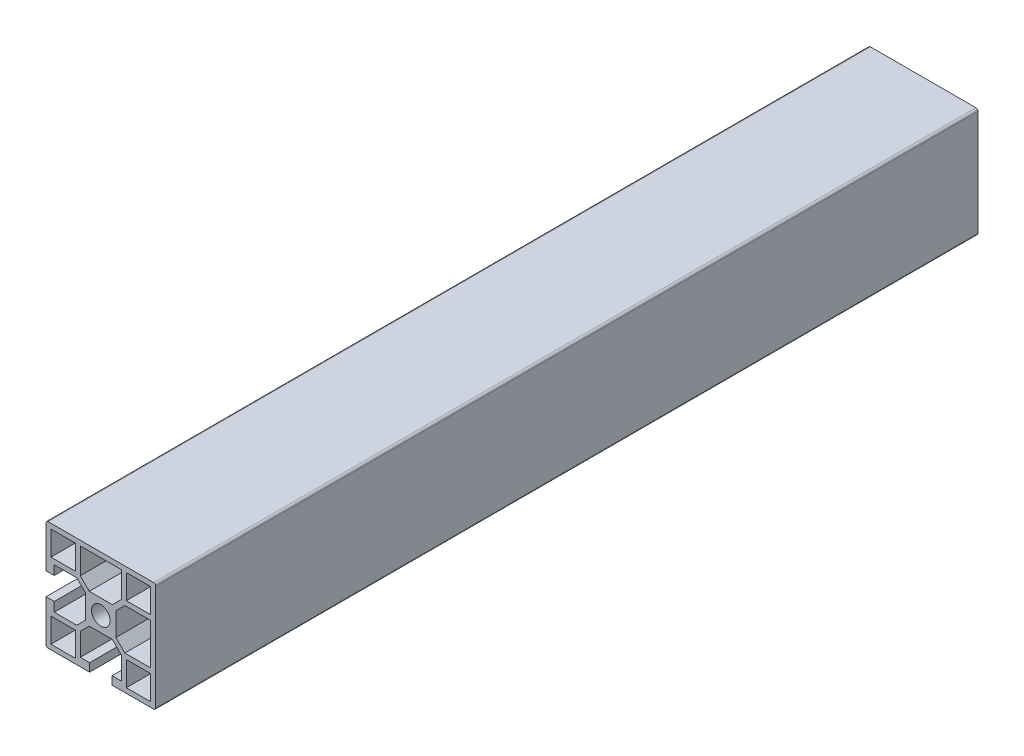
ISO-10303-21;
HEADER;
FILE_DESCRIPTION(('STEP AP214'),'2;1');
FILE_NAME('part.step','',(''),(''),'','','');
FILE_SCHEMA(('AUTOMOTIVE_DESIGN { 1 0 10303 214 1 1 1 1 }'));
ENDSEC;
DATA;
#1=APPLICATION_CONTEXT('core data for automotive mechanical design processes');
#2=APPLICATION_PROTOCOL_DEFINITION('international standard','automotive_design',2000,#1);
#3=PRODUCT_CONTEXT('',#1,'mechanical');
#4=PRODUCT('Part','Part','',(#3));
#5=PRODUCT_RELATED_PRODUCT_CATEGORY('part','',(#4));
#6=PRODUCT_DEFINITION_FORMATION('','',#4);
#7=PRODUCT_DEFINITION_CONTEXT('part definition',#1,'design');
#8=PRODUCT_DEFINITION('design','',#6,#7);
#9=PRODUCT_DEFINITION_SHAPE('','',#8);
#10=(LENGTH_UNIT() NAMED_UNIT(*) SI_UNIT(.MILLI.,.METRE.));
#11=(NAMED_UNIT(*) PLANE_ANGLE_UNIT() SI_UNIT($,.RADIAN.));
#12=(NAMED_UNIT(*) SI_UNIT($,.STERADIAN.) SOLID_ANGLE_UNIT());
#13=UNCERTAINTY_MEASURE_WITH_UNIT(LENGTH_MEASURE(1.E-05),#10,'distance_accuracy_value','');
#14=(GEOMETRIC_REPRESENTATION_CONTEXT(3) GLOBAL_UNCERTAINTY_ASSIGNED_CONTEXT((#13)) GLOBAL_UNIT_ASSIGNED_CONTEXT((#10,
#11,#12)) REPRESENTATION_CONTEXT('',''));
#15=CARTESIAN_POINT('',(0.,0.,0.));
#16=DIRECTION('',(0.,0.,1.));
#17=DIRECTION('',(1.,0.,0.));
#18=AXIS2_PLACEMENT_3D('',#15,#16,#17);
#19=CARTESIAN_POINT('',(8034.22933011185,2644.72280872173,300.));
#20=DIRECTION('',(0.,0.,1.));
#21=DIRECTION('',(1.,0.,0.));
#22=AXIS2_PLACEMENT_3D('',#19,#20,#21);
#23=PLANE('',#22);
#24=CARTESIAN_POINT('',(8034.22933011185,2644.72280872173,300.));
#25=DIRECTION('',(0.,0.,1.));
#26=DIRECTION('',(1.,0.,0.));
#27=AXIS2_PLACEMENT_3D('',#24,#25,#26);
#28=CIRCLE('',#27,0.750000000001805);
#29=CARTESIAN_POINT('',(8034.22933011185,2645.47280872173,300.));
#30=VERTEX_POINT('',#29);
#31=CARTESIAN_POINT('',(8033.47933011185,2644.72280872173,300.));
#32=VERTEX_POINT('',#31);
#33=EDGE_CURVE('E611',#30,#32,#28,.T.);
#34=ORIENTED_EDGE('',*,*,#33,.T.);
#35=DIRECTION('',(0.,-1.,0.));
#36=VECTOR('',#35,1.);
#37=CARTESIAN_POINT('',(8033.47933011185,2644.72280872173,300.));
#38=LINE('',#37,#36);
#39=CARTESIAN_POINT('',(8033.47933011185,2629.57280872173,300.));
#40=VERTEX_POINT('',#39);
#41=EDGE_CURVE('E614',#32,#40,#38,.T.);
#42=ORIENTED_EDGE('',*,*,#41,.T.);
#43=DIRECTION('',(1.,0.,0.));
#44=VECTOR('',#43,1.);
#45=CARTESIAN_POINT('',(8033.47933011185,2629.57280872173,300.));
#46=LINE('',#45,#44);
#47=CARTESIAN_POINT('',(8036.47933011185,2629.57280872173,300.));
#48=VERTEX_POINT('',#47);
#49=EDGE_CURVE('E617',#40,#48,#46,.T.);
#50=ORIENTED_EDGE('',*,*,#49,.T.);
#51=DIRECTION('',(0.,1.,0.));
#52=VECTOR('',#51,1.);
#53=CARTESIAN_POINT('',(8036.47933011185,2629.57280872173,300.));
#54=LINE('',#53,#52);
#55=CARTESIAN_POINT('',(8036.47933011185,2632.97280872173,300.));
#56=VERTEX_POINT('',#55);
#57=EDGE_CURVE('E619',#48,#56,#54,.T.);
#58=ORIENTED_EDGE('',*,*,#57,.T.);
#59=DIRECTION('',(1.,0.,0.));
#60=VECTOR('',#59,1.);
#61=CARTESIAN_POINT('',(8036.47933011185,2632.97280872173,300.));
#62=LINE('',#61,#60);
#63=CARTESIAN_POINT('',(8044.70653790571,2632.97280872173,300.));
#64=VERTEX_POINT('',#63);
#65=EDGE_CURVE('E621',#56,#64,#62,.T.);
#66=ORIENTED_EDGE('',*,*,#65,.T.);
#67=DIRECTION('',(0.7071067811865,-0.707106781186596,0.));
#68=VECTOR('',#67,1.);
#69=CARTESIAN_POINT('',(8044.70653790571,2632.97280872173,300.));
#70=LINE('',#69,#68);
#71=CARTESIAN_POINT('',(8047.97933011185,2629.7000165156,300.));
#72=VERTEX_POINT('',#71);
#73=EDGE_CURVE('E623',#64,#72,#70,.T.);
#74=ORIENTED_EDGE('',*,*,#73,.T.);
#75=DIRECTION('',(0.,-1.,0.));
#76=VECTOR('',#75,1.);
#77=CARTESIAN_POINT('',(8047.97933011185,2629.7000165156,300.));
#78=LINE('',#77,#76);
#79=CARTESIAN_POINT('',(8047.97933011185,2621.24560092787,300.));
#80=VERTEX_POINT('',#79);
#81=EDGE_CURVE('E625',#72,#80,#78,.T.);
#82=ORIENTED_EDGE('',*,*,#81,.T.);
#83=DIRECTION('',(-0.707106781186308,-0.707106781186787,0.));
#84=VECTOR('',#83,1.);
#85=CARTESIAN_POINT('',(8047.97933011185,2621.24560092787,300.));
#86=LINE('',#85,#84);
#87=CARTESIAN_POINT('',(8044.70653790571,2617.97280872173,300.));
#88=VERTEX_POINT('',#87);
#89=EDGE_CURVE('E627',#80,#88,#86,.T.);
#90=ORIENTED_EDGE('',*,*,#89,.T.);
#91=DIRECTION('',(-1.,0.,0.));
#92=VECTOR('',#91,1.);
#93=CARTESIAN_POINT('',(8044.70653790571,2617.97280872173,300.));
#94=LINE('',#93,#92);
#95=CARTESIAN_POINT('',(8036.47933011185,2617.97280872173,300.));
#96=VERTEX_POINT('',#95);
#97=EDGE_CURVE('E629',#88,#96,#94,.T.);
#98=ORIENTED_EDGE('',*,*,#97,.T.);
#99=DIRECTION('',(0.,1.,0.));
#100=VECTOR('',#99,1.);
#101=CARTESIAN_POINT('',(8036.47933011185,2617.97280872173,300.));
#102=LINE('',#101,#100);
#103=CARTESIAN_POINT('',(8036.47933011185,2621.37280872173,300.));
#104=VERTEX_POINT('',#103);
#105=EDGE_CURVE('E631',#96,#104,#102,.T.);
#106=ORIENTED_EDGE('',*,*,#105,.T.);
#107=DIRECTION('',(-1.,0.,0.));
#108=VECTOR('',#107,1.);
#109=CARTESIAN_POINT('',(8036.47933011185,2621.37280872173,300.));
#110=LINE('',#109,#108);
#111=CARTESIAN_POINT('',(8033.47933011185,2621.37280872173,300.));
#112=VERTEX_POINT('',#111);
#113=EDGE_CURVE('E633',#104,#112,#110,.T.);
#114=ORIENTED_EDGE('',*,*,#113,.T.);
#115=DIRECTION('',(0.,-1.,0.));
#116=VECTOR('',#115,1.);
#117=CARTESIAN_POINT('',(8033.47933011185,2621.37280872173,300.));
#118=LINE('',#117,#116);
#119=CARTESIAN_POINT('',(8033.47933011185,2606.22280872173,300.));
#120=VERTEX_POINT('',#119);
#121=EDGE_CURVE('E635',#112,#120,#118,.T.);
#122=ORIENTED_EDGE('',*,*,#121,.T.);
#123=CARTESIAN_POINT('',(8034.22933011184,2606.22280872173,300.));
#124=DIRECTION('',(0.,0.,1.));
#125=DIRECTION('',(1.,0.,0.));
#126=AXIS2_PLACEMENT_3D('',#123,#124,#125);
#127=CIRCLE('',#126,0.749999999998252);
#128=CARTESIAN_POINT('',(8034.22933011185,2605.47280872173,300.));
#129=VERTEX_POINT('',#128);
#130=EDGE_CURVE('E637',#120,#129,#127,.T.);
#131=ORIENTED_EDGE('',*,*,#130,.T.);
#132=DIRECTION('',(1.,0.,0.));
#133=VECTOR('',#132,1.);
#134=CARTESIAN_POINT('',(8034.22933011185,2605.47280872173,300.));
#135=LINE('',#134,#133);
#136=CARTESIAN_POINT('',(8049.37933011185,2605.47280872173,300.));
#137=VERTEX_POINT('',#136);
#138=EDGE_CURVE('E639',#129,#137,#135,.T.);
#139=ORIENTED_EDGE('',*,*,#138,.T.);
#140=DIRECTION('',(0.,1.,0.));
#141=VECTOR('',#140,1.);
#142=CARTESIAN_POINT('',(8049.37933011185,2605.47280872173,300.));
#143=LINE('',#142,#141);
#144=CARTESIAN_POINT('',(8049.37933011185,2608.47280872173,300.));
#145=VERTEX_POINT('',#144);
#146=EDGE_CURVE('E641',#137,#145,#143,.T.);
#147=ORIENTED_EDGE('',*,*,#146,.T.);
#148=DIRECTION('',(-1.,0.,0.));
#149=VECTOR('',#148,1.);
#150=CARTESIAN_POINT('',(8049.37933011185,2608.47280872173,300.));
#151=LINE('',#150,#149);
#152=CARTESIAN_POINT('',(8045.97933011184,2608.47280872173,300.));
#153=VERTEX_POINT('',#152);
#154=EDGE_CURVE('E643',#145,#153,#151,.T.);
#155=ORIENTED_EDGE('',*,*,#154,.T.);
#156=DIRECTION('',(0.,1.,0.));
#157=VECTOR('',#156,1.);
#158=CARTESIAN_POINT('',(8045.97933011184,2608.47280872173,300.));
#159=LINE('',#158,#157);
#160=CARTESIAN_POINT('',(8045.97933011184,2616.7000165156,300.));
#161=VERTEX_POINT('',#160);
#162=EDGE_CURVE('E645',#153,#161,#159,.T.);
#163=ORIENTED_EDGE('',*,*,#162,.T.);
#164=DIRECTION('',(0.707106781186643,0.707106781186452,0.));
#165=VECTOR('',#164,1.);
#166=CARTESIAN_POINT('',(8045.97933011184,2616.7000165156,300.));
#167=LINE('',#166,#165);
#168=CARTESIAN_POINT('',(8049.25212231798,2619.97280872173,300.));
#169=VERTEX_POINT('',#168);
#170=EDGE_CURVE('E647',#161,#169,#167,.T.);
#171=ORIENTED_EDGE('',*,*,#170,.T.);
#172=DIRECTION('',(1.,0.,0.));
#173=VECTOR('',#172,1.);
#174=CARTESIAN_POINT('',(8049.25212231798,2619.97280872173,300.));
#175=LINE('',#174,#173);
#176=CARTESIAN_POINT('',(8057.70653790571,2619.97280872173,300.));
#177=VERTEX_POINT('',#176);
#178=EDGE_CURVE('E649',#169,#177,#175,.T.);
#179=ORIENTED_EDGE('',*,*,#178,.T.);
#180=DIRECTION('',(0.707106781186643,-0.707106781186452,0.));
#181=VECTOR('',#180,1.);
#182=CARTESIAN_POINT('',(8057.70653790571,2619.97280872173,300.));
#183=LINE('',#182,#181);
#184=CARTESIAN_POINT('',(8060.97933011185,2616.7000165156,300.));
#185=VERTEX_POINT('',#184);
#186=EDGE_CURVE('E651',#177,#185,#183,.T.);
#187=ORIENTED_EDGE('',*,*,#186,.T.);
#188=DIRECTION('',(0.,-1.,0.));
#189=VECTOR('',#188,1.);
#190=CARTESIAN_POINT('',(8060.97933011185,2616.7000165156,300.));
#191=LINE('',#190,#189);
#192=CARTESIAN_POINT('',(8060.97933011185,2608.47280872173,300.));
#193=VERTEX_POINT('',#192);
#194=EDGE_CURVE('E653',#185,#193,#191,.T.);
#195=ORIENTED_EDGE('',*,*,#194,.T.);
#196=DIRECTION('',(-1.,0.,0.));
#197=VECTOR('',#196,1.);
#198=CARTESIAN_POINT('',(8060.97933011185,2608.47280872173,300.));
#199=LINE('',#198,#197);
#200=CARTESIAN_POINT('',(8057.57933011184,2608.47280872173,300.));
#201=VERTEX_POINT('',#200);
#202=EDGE_CURVE('E655',#193,#201,#199,.T.);
#203=ORIENTED_EDGE('',*,*,#202,.T.);
#204=DIRECTION('',(0.,-1.,0.));
#205=VECTOR('',#204,1.);
#206=CARTESIAN_POINT('',(8057.57933011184,2608.47280872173,300.));
#207=LINE('',#206,#205);
#208=CARTESIAN_POINT('',(8057.57933011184,2605.47280872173,300.));
#209=VERTEX_POINT('',#208);
#210=EDGE_CURVE('E657',#201,#209,#207,.T.);
#211=ORIENTED_EDGE('',*,*,#210,.T.);
#212=DIRECTION('',(1.,0.,0.));
#213=VECTOR('',#212,1.);
#214=CARTESIAN_POINT('',(8057.57933011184,2605.47280872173,300.));
#215=LINE('',#214,#213);
#216=CARTESIAN_POINT('',(8072.72933011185,2605.47280872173,300.));
#217=VERTEX_POINT('',#216);
#218=EDGE_CURVE('E659',#209,#217,#215,.T.);
#219=ORIENTED_EDGE('',*,*,#218,.T.);
#220=CARTESIAN_POINT('',(8072.72933011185,2606.22280872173,300.));
#221=DIRECTION('',(0.,0.,1.));
#222=DIRECTION('',(1.,0.,0.));
#223=AXIS2_PLACEMENT_3D('',#220,#221,#222);
#224=CIRCLE('',#223,0.749999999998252);
#225=CARTESIAN_POINT('',(8073.47933011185,2606.22280872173,300.));
#226=VERTEX_POINT('',#225);
#227=EDGE_CURVE('E661',#217,#226,#224,.T.);
#228=ORIENTED_EDGE('',*,*,#227,.T.);
#229=DIRECTION('',(0.,1.,0.));
#230=VECTOR('',#229,1.);
#231=CARTESIAN_POINT('',(8073.47933011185,2606.22280872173,300.));
#232=LINE('',#231,#230);
#233=CARTESIAN_POINT('',(8073.47933011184,2644.72280872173,300.));
#234=VERTEX_POINT('',#233);
#235=EDGE_CURVE('E663',#226,#234,#232,.T.);
#236=ORIENTED_EDGE('',*,*,#235,.T.);
#237=CARTESIAN_POINT('',(8072.72933011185,2644.72280872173,300.));
#238=DIRECTION('',(0.,0.,1.));
#239=DIRECTION('',(1.,0.,0.));
#240=AXIS2_PLACEMENT_3D('',#237,#238,#239);
#241=CIRCLE('',#240,0.749999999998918);
#242=CARTESIAN_POINT('',(8072.72933011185,2645.47280872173,300.));
#243=VERTEX_POINT('',#242);
#244=EDGE_CURVE('E665',#234,#243,#241,.T.);
#245=ORIENTED_EDGE('',*,*,#244,.T.);
#246=DIRECTION('',(-1.,0.,0.));
#247=VECTOR('',#246,1.);
#248=CARTESIAN_POINT('',(8072.72933011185,2645.47280872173,300.));
#249=LINE('',#248,#247);
#250=EDGE_CURVE('E667',#243,#30,#249,.T.);
#251=ORIENTED_EDGE('',*,*,#250,.T.);
#252=EDGE_LOOP('',(#34,#42,#50,#58,#66,#74,#82,#90,#98,#106,#114,#122,#131,#139,#147,#155,#163,
#171,#179,#187,#195,#203,#211,#219,#228,#236,#245,#251));
#253=FACE_BOUND('',#252,.T.);
#254=CARTESIAN_POINT('',(8053.47933011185,2625.47280872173,300.));
#255=DIRECTION('',(0.,0.,1.));
#256=DIRECTION('',(1.,0.,0.));
#257=AXIS2_PLACEMENT_3D('',#254,#255,#256);
#258=CIRCLE('',#257,3.39999999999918);
#259=CARTESIAN_POINT('',(8056.87933011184,2625.47280872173,300.));
#260=VERTEX_POINT('',#259);
#261=EDGE_CURVE('E605',#260,#260,#258,.T.);
#262=ORIENTED_EDGE('',*,*,#261,.F.);
#263=EDGE_LOOP('',(#262));
#264=FACE_BOUND('',#263,.T.);
#265=DIRECTION('',(0.,-1.,0.));
#266=VECTOR('',#265,1.);
#267=CARTESIAN_POINT('',(8035.27933011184,2607.27280872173,300.));
#268=LINE('',#267,#266);
#269=CARTESIAN_POINT('',(8035.27933011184,2616.17280872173,300.));
#270=VERTEX_POINT('',#269);
#271=CARTESIAN_POINT('',(8035.27933011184,2607.27280872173,300.));
#272=VERTEX_POINT('',#271);
#273=EDGE_CURVE('E576',#270,#272,#268,.T.);
#274=ORIENTED_EDGE('',*,*,#273,.F.);
#275=DIRECTION('',(-1.,0.,0.));
#276=VECTOR('',#275,1.);
#277=CARTESIAN_POINT('',(8035.27933011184,2616.17280872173,300.));
#278=LINE('',#277,#276);
#279=CARTESIAN_POINT('',(8044.17933011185,2616.17280872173,300.));
#280=VERTEX_POINT('',#279);
#281=EDGE_CURVE('E574',#280,#270,#278,.T.);
#282=ORIENTED_EDGE('',*,*,#281,.F.);
#283=DIRECTION('',(0.,1.,0.));
#284=VECTOR('',#283,1.);
#285=CARTESIAN_POINT('',(8044.17933011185,2616.17280872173,300.));
#286=LINE('',#285,#284);
#287=CARTESIAN_POINT('',(8044.17933011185,2607.27280872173,300.));
#288=VERTEX_POINT('',#287);
#289=EDGE_CURVE('E582',#288,#280,#286,.T.);
#290=ORIENTED_EDGE('',*,*,#289,.F.);
#291=DIRECTION('',(1.,0.,0.));
#292=VECTOR('',#291,1.);
#293=CARTESIAN_POINT('',(8044.17933011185,2607.27280872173,300.));
#294=LINE('',#293,#292);
#295=EDGE_CURVE('E579',#272,#288,#294,.T.);
#296=ORIENTED_EDGE('',*,*,#295,.F.);
#297=EDGE_LOOP('',(#274,#282,#290,#296));
#298=FACE_BOUND('',#297,.T.);
#299=DIRECTION('',(0.,-1.,0.));
#300=VECTOR('',#299,1.);
#301=CARTESIAN_POINT('',(8035.27933011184,2634.77280872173,300.));
#302=LINE('',#301,#300);
#303=CARTESIAN_POINT('',(8035.27933011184,2643.67280872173,300.));
#304=VERTEX_POINT('',#303);
#305=CARTESIAN_POINT('',(8035.27933011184,2634.77280872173,300.));
#306=VERTEX_POINT('',#305);
#307=EDGE_CURVE('E545',#304,#306,#302,.T.);
#308=ORIENTED_EDGE('',*,*,#307,.F.);
#309=DIRECTION('',(-1.,0.,0.));
#310=VECTOR('',#309,1.);
#311=CARTESIAN_POINT('',(8035.27933011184,2643.67280872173,300.));
#312=LINE('',#311,#310);
#313=CARTESIAN_POINT('',(8044.17933011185,2643.67280872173,300.));
#314=VERTEX_POINT('',#313);
#315=EDGE_CURVE('E543',#314,#304,#312,.T.);
#316=ORIENTED_EDGE('',*,*,#315,.F.);
#317=DIRECTION('',(0.,1.,0.));
#318=VECTOR('',#317,1.);
#319=CARTESIAN_POINT('',(8044.17933011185,2643.67280872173,300.));
#320=LINE('',#319,#318);
#321=CARTESIAN_POINT('',(8044.17933011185,2634.77280872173,300.));
#322=VERTEX_POINT('',#321);
#323=EDGE_CURVE('E551',#322,#314,#320,.T.);
#324=ORIENTED_EDGE('',*,*,#323,.F.);
#325=DIRECTION('',(1.,0.,0.));
#326=VECTOR('',#325,1.);
#327=CARTESIAN_POINT('',(8044.17933011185,2634.77280872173,300.));
#328=LINE('',#327,#326);
#329=EDGE_CURVE('E548',#306,#322,#328,.T.);
#330=ORIENTED_EDGE('',*,*,#329,.F.);
#331=EDGE_LOOP('',(#308,#316,#324,#330));
#332=FACE_BOUND('',#331,.T.);
#333=DIRECTION('',(0.,1.,0.));
#334=VECTOR('',#333,1.);
#335=CARTESIAN_POINT('',(8060.97933011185,2643.67280872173,300.));
#336=LINE('',#335,#334);
#337=CARTESIAN_POINT('',(8060.97933011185,2634.24560092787,300.));
#338=VERTEX_POINT('',#337);
#339=CARTESIAN_POINT('',(8060.97933011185,2643.67280872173,300.));
#340=VERTEX_POINT('',#339);
#341=EDGE_CURVE('E500',#338,#340,#336,.T.);
#342=ORIENTED_EDGE('',*,*,#341,.F.);
#343=DIRECTION('',(0.7071067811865,0.707106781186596,0.));
#344=VECTOR('',#343,1.);
#345=CARTESIAN_POINT('',(8060.97933011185,2634.24560092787,300.));
#346=LINE('',#345,#344);
#347=CARTESIAN_POINT('',(8057.70653790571,2630.97280872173,300.));
#348=VERTEX_POINT('',#347);
#349=EDGE_CURVE('E498',#348,#338,#346,.T.);
#350=ORIENTED_EDGE('',*,*,#349,.F.);
#351=DIRECTION('',(1.,0.,0.));
#352=VECTOR('',#351,1.);
#353=CARTESIAN_POINT('',(8057.70653790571,2630.97280872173,300.));
#354=LINE('',#353,#352);
#355=CARTESIAN_POINT('',(8049.25212231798,2630.97280872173,300.));
#356=VERTEX_POINT('',#355);
#357=EDGE_CURVE('E510',#356,#348,#354,.T.);
#358=ORIENTED_EDGE('',*,*,#357,.F.);
#359=DIRECTION('',(0.70710678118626,-0.707106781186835,0.));
#360=VECTOR('',#359,1.);
#361=CARTESIAN_POINT('',(8049.25212231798,2630.97280872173,300.));
#362=LINE('',#361,#360);
#363=CARTESIAN_POINT('',(8045.97933011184,2634.24560092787,300.));
#364=VERTEX_POINT('',#363);
#365=EDGE_CURVE('E507',#364,#356,#362,.T.);
#366=ORIENTED_EDGE('',*,*,#365,.F.);
#367=DIRECTION('',(0.,-1.,0.));
#368=VECTOR('',#367,1.);
#369=CARTESIAN_POINT('',(8045.97933011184,2634.24560092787,300.));
#370=LINE('',#369,#368);
#371=CARTESIAN_POINT('',(8045.97933011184,2643.67280872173,300.));
#372=VERTEX_POINT('',#371);
#373=EDGE_CURVE('E505',#372,#364,#370,.T.);
#374=ORIENTED_EDGE('',*,*,#373,.F.);
#375=DIRECTION('',(-1.,0.,0.));
#376=VECTOR('',#375,1.);
#377=CARTESIAN_POINT('',(8045.97933011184,2643.67280872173,300.));
#378=LINE('',#377,#376);
#379=EDGE_CURVE('E503',#340,#372,#378,.T.);
#380=ORIENTED_EDGE('',*,*,#379,.F.);
#381=EDGE_LOOP('',(#342,#350,#358,#366,#374,#380));
#382=FACE_BOUND('',#381,.T.);
#383=DIRECTION('',(0.,1.,0.));
#384=VECTOR('',#383,1.);
#385=CARTESIAN_POINT('',(8071.67933011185,2616.17280872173,300.));
#386=LINE('',#385,#384);
#387=CARTESIAN_POINT('',(8071.67933011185,2607.27280872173,300.));
#388=VERTEX_POINT('',#387);
#389=CARTESIAN_POINT('',(8071.67933011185,2616.17280872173,300.));
#390=VERTEX_POINT('',#389);
#391=EDGE_CURVE('E469',#388,#390,#386,.T.);
#392=ORIENTED_EDGE('',*,*,#391,.F.);
#393=DIRECTION('',(1.,0.,0.));
#394=VECTOR('',#393,1.);
#395=CARTESIAN_POINT('',(8071.67933011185,2607.27280872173,300.));
#396=LINE('',#395,#394);
#397=CARTESIAN_POINT('',(8062.77933011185,2607.27280872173,300.));
#398=VERTEX_POINT('',#397);
#399=EDGE_CURVE('E467',#398,#388,#396,.T.);
#400=ORIENTED_EDGE('',*,*,#399,.F.);
#401=DIRECTION('',(0.,-1.,0.));
#402=VECTOR('',#401,1.);
#403=CARTESIAN_POINT('',(8062.77933011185,2607.27280872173,300.));
#404=LINE('',#403,#402);
#405=CARTESIAN_POINT('',(8062.77933011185,2616.17280872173,300.));
#406=VERTEX_POINT('',#405);
#407=EDGE_CURVE('E475',#406,#398,#404,.T.);
#408=ORIENTED_EDGE('',*,*,#407,.F.);
#409=DIRECTION('',(-1.,0.,0.));
#410=VECTOR('',#409,1.);
#411=CARTESIAN_POINT('',(8062.77933011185,2616.17280872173,300.));
#412=LINE('',#411,#410);
#413=EDGE_CURVE('E472',#390,#406,#412,.T.);
#414=ORIENTED_EDGE('',*,*,#413,.F.);
#415=EDGE_LOOP('',(#392,#400,#408,#414));
#416=FACE_BOUND('',#415,.T.);
#417=DIRECTION('',(0.,-1.,0.));
#418=VECTOR('',#417,1.);
#419=CARTESIAN_POINT('',(8058.97933011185,2621.24560092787,300.));
#420=LINE('',#419,#418);
#421=CARTESIAN_POINT('',(8058.97933011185,2629.7000165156,300.));
#422=VERTEX_POINT('',#421);
#423=CARTESIAN_POINT('',(8058.97933011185,2621.24560092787,300.));
#424=VERTEX_POINT('',#423);
#425=EDGE_CURVE('E424',#422,#424,#420,.T.);
#426=ORIENTED_EDGE('',*,*,#425,.F.);
#427=DIRECTION('',(-0.707106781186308,-0.707106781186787,0.));
#428=VECTOR('',#427,1.);
#429=CARTESIAN_POINT('',(8058.97933011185,2629.7000165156,300.));
#430=LINE('',#429,#428);
#431=CARTESIAN_POINT('',(8062.25212231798,2632.97280872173,300.));
#432=VERTEX_POINT('',#431);
#433=EDGE_CURVE('E422',#432,#422,#430,.T.);
#434=ORIENTED_EDGE('',*,*,#433,.F.);
#435=DIRECTION('',(-1.,0.,0.));
#436=VECTOR('',#435,1.);
#437=CARTESIAN_POINT('',(8062.25212231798,2632.97280872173,300.));
#438=LINE('',#437,#436);
#439=CARTESIAN_POINT('',(8071.67933011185,2632.97280872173,300.));
#440=VERTEX_POINT('',#439);
#441=EDGE_CURVE('E434',#440,#432,#438,.T.);
#442=ORIENTED_EDGE('',*,*,#441,.F.);
#443=DIRECTION('',(0.,1.,0.));
#444=VECTOR('',#443,1.);
#445=CARTESIAN_POINT('',(8071.67933011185,2632.97280872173,300.));
#446=LINE('',#445,#444);
#447=CARTESIAN_POINT('',(8071.67933011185,2617.97280872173,300.));
#448=VERTEX_POINT('',#447);
#449=EDGE_CURVE('E431',#448,#440,#446,.T.);
#450=ORIENTED_EDGE('',*,*,#449,.F.);
#451=DIRECTION('',(1.,0.,0.));
#452=VECTOR('',#451,1.);
#453=CARTESIAN_POINT('',(8071.67933011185,2617.97280872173,300.));
#454=LINE('',#453,#452);
#455=CARTESIAN_POINT('',(8062.25212231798,2617.97280872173,300.));
#456=VERTEX_POINT('',#455);
#457=EDGE_CURVE('E429',#456,#448,#454,.T.);
#458=ORIENTED_EDGE('',*,*,#457,.F.);
#459=DIRECTION('',(0.707106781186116,-0.707106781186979,0.));
#460=VECTOR('',#459,1.);
#461=CARTESIAN_POINT('',(8062.25212231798,2617.97280872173,300.));
#462=LINE('',#461,#460);
#463=EDGE_CURVE('E427',#424,#456,#462,.T.);
#464=ORIENTED_EDGE('',*,*,#463,.F.);
#465=EDGE_LOOP('',(#426,#434,#442,#450,#458,#464));
#466=FACE_BOUND('',#465,.T.);
#467=DIRECTION('',(0.,1.,0.));
#468=VECTOR('',#467,1.);
#469=CARTESIAN_POINT('',(8071.67933011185,2643.67280872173,300.));
#470=LINE('',#469,#468);
#471=CARTESIAN_POINT('',(8071.67933011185,2634.77280872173,300.));
#472=VERTEX_POINT('',#471);
#473=CARTESIAN_POINT('',(8071.67933011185,2643.67280872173,300.));
#474=VERTEX_POINT('',#473);
#475=EDGE_CURVE('E394',#472,#474,#470,.T.);
#476=ORIENTED_EDGE('',*,*,#475,.F.);
#477=DIRECTION('',(1.,0.,0.));
#478=VECTOR('',#477,1.);
#479=CARTESIAN_POINT('',(8071.67933011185,2634.77280872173,300.));
#480=LINE('',#479,#478);
#481=CARTESIAN_POINT('',(8062.77933011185,2634.77280872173,300.));
#482=VERTEX_POINT('',#481);
#483=EDGE_CURVE('E386',#482,#472,#480,.T.);
#484=ORIENTED_EDGE('',*,*,#483,.F.);
#485=DIRECTION('',(0.,-1.,0.));
#486=VECTOR('',#485,1.);
#487=CARTESIAN_POINT('',(8062.77933011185,2634.77280872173,300.));
#488=LINE('',#487,#486);
#489=CARTESIAN_POINT('',(8062.77933011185,2643.67280872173,300.));
#490=VERTEX_POINT('',#489);
#491=EDGE_CURVE('E408',#490,#482,#488,.T.);
#492=ORIENTED_EDGE('',*,*,#491,.F.);
#493=DIRECTION('',(-1.,0.,0.));
#494=VECTOR('',#493,1.);
#495=CARTESIAN_POINT('',(8062.77933011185,2643.67280872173,300.));
#496=LINE('',#495,#494);
#497=EDGE_CURVE('E406',#474,#490,#496,.T.);
#498=ORIENTED_EDGE('',*,*,#497,.F.);
#499=EDGE_LOOP('',(#476,#484,#492,#498));
#500=FACE_BOUND('',#499,.T.);
#501=ADVANCED_FACE('F33',(#253,#264,#298,#332,#382,#416,#466,#500),#23,.T.);
#502=CARTESIAN_POINT('',(8034.22933011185,2644.72280872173,0.));
#503=DIRECTION('',(0.,0.,1.));
#504=DIRECTION('',(1.,0.,0.));
#505=AXIS2_PLACEMENT_3D('',#502,#503,#504);
#506=PLANE('',#505);
#507=DIRECTION('',(-0.707106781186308,-0.707106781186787,0.));
#508=VECTOR('',#507,1.);
#509=CARTESIAN_POINT('',(8058.97933011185,2629.7000165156,0.));
#510=LINE('',#509,#508);
#511=CARTESIAN_POINT('',(8062.25212231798,2632.97280872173,0.));
#512=VERTEX_POINT('',#511);
#513=CARTESIAN_POINT('',(8058.97933011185,2629.7000165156,0.));
#514=VERTEX_POINT('',#513);
#515=EDGE_CURVE('E402',#512,#514,#510,.T.);
#516=ORIENTED_EDGE('',*,*,#515,.T.);
#517=DIRECTION('',(0.,-1.,0.));
#518=VECTOR('',#517,1.);
#519=CARTESIAN_POINT('',(8058.97933011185,2621.24560092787,0.));
#520=LINE('',#519,#518);
#521=CARTESIAN_POINT('',(8058.97933011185,2621.24560092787,0.));
#522=VERTEX_POINT('',#521);
#523=EDGE_CURVE('E439',#514,#522,#520,.T.);
#524=ORIENTED_EDGE('',*,*,#523,.T.);
#525=DIRECTION('',(0.707106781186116,-0.707106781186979,0.));
#526=VECTOR('',#525,1.);
#527=CARTESIAN_POINT('',(8062.25212231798,2617.97280872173,0.));
#528=LINE('',#527,#526);
#529=CARTESIAN_POINT('',(8062.25212231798,2617.97280872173,0.));
#530=VERTEX_POINT('',#529);
#531=EDGE_CURVE('E442',#522,#530,#528,.T.);
#532=ORIENTED_EDGE('',*,*,#531,.T.);
#533=DIRECTION('',(1.,0.,0.));
#534=VECTOR('',#533,1.);
#535=CARTESIAN_POINT('',(8071.67933011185,2617.97280872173,0.));
#536=LINE('',#535,#534);
#537=CARTESIAN_POINT('',(8071.67933011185,2617.97280872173,0.));
#538=VERTEX_POINT('',#537);
#539=EDGE_CURVE('E445',#530,#538,#536,.T.);
#540=ORIENTED_EDGE('',*,*,#539,.T.);
#541=DIRECTION('',(0.,1.,0.));
#542=VECTOR('',#541,1.);
#543=CARTESIAN_POINT('',(8071.67933011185,2632.97280872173,0.));
#544=LINE('',#543,#542);
#545=CARTESIAN_POINT('',(8071.67933011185,2632.97280872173,0.));
#546=VERTEX_POINT('',#545);
#547=EDGE_CURVE('E448',#538,#546,#544,.T.);
#548=ORIENTED_EDGE('',*,*,#547,.T.);
#549=DIRECTION('',(-1.,0.,0.));
#550=VECTOR('',#549,1.);
#551=CARTESIAN_POINT('',(8062.25212231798,2632.97280872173,0.));
#552=LINE('',#551,#550);
#553=EDGE_CURVE('E425',#546,#512,#552,.T.);
#554=ORIENTED_EDGE('',*,*,#553,.T.);
#555=EDGE_LOOP('',(#516,#524,#532,#540,#548,#554));
#556=FACE_BOUND('',#555,.T.);
#557=DIRECTION('',(0.7071067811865,0.707106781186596,0.));
#558=VECTOR('',#557,1.);
#559=CARTESIAN_POINT('',(8060.97933011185,2634.24560092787,0.));
#560=LINE('',#559,#558);
#561=CARTESIAN_POINT('',(8057.70653790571,2630.97280872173,0.));
#562=VERTEX_POINT('',#561);
#563=CARTESIAN_POINT('',(8060.97933011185,2634.24560092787,0.));
#564=VERTEX_POINT('',#563);
#565=EDGE_CURVE('E497',#562,#564,#560,.T.);
#566=ORIENTED_EDGE('',*,*,#565,.T.);
#567=DIRECTION('',(0.,1.,0.));
#568=VECTOR('',#567,1.);
#569=CARTESIAN_POINT('',(8060.97933011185,2643.67280872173,0.));
#570=LINE('',#569,#568);
#571=CARTESIAN_POINT('',(8060.97933011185,2643.67280872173,0.));
#572=VERTEX_POINT('',#571);
#573=EDGE_CURVE('E515',#564,#572,#570,.T.);
#574=ORIENTED_EDGE('',*,*,#573,.T.);
#575=DIRECTION('',(-1.,0.,0.));
#576=VECTOR('',#575,1.);
#577=CARTESIAN_POINT('',(8045.97933011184,2643.67280872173,0.));
#578=LINE('',#577,#576);
#579=CARTESIAN_POINT('',(8045.97933011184,2643.67280872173,0.));
#580=VERTEX_POINT('',#579);
#581=EDGE_CURVE('E518',#572,#580,#578,.T.);
#582=ORIENTED_EDGE('',*,*,#581,.T.);
#583=DIRECTION('',(0.,-1.,0.));
#584=VECTOR('',#583,1.);
#585=CARTESIAN_POINT('',(8045.97933011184,2634.24560092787,0.));
#586=LINE('',#585,#584);
#587=CARTESIAN_POINT('',(8045.97933011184,2634.24560092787,0.));
#588=VERTEX_POINT('',#587);
#589=EDGE_CURVE('E521',#580,#588,#586,.T.);
#590=ORIENTED_EDGE('',*,*,#589,.T.);
#591=DIRECTION('',(0.70710678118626,-0.707106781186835,0.));
#592=VECTOR('',#591,1.);
#593=CARTESIAN_POINT('',(8049.25212231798,2630.97280872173,0.));
#594=LINE('',#593,#592);
#595=CARTESIAN_POINT('',(8049.25212231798,2630.97280872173,0.));
#596=VERTEX_POINT('',#595);
#597=EDGE_CURVE('E524',#588,#596,#594,.T.);
#598=ORIENTED_EDGE('',*,*,#597,.T.);
#599=DIRECTION('',(1.,0.,0.));
#600=VECTOR('',#599,1.);
#601=CARTESIAN_POINT('',(8057.70653790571,2630.97280872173,0.));
#602=LINE('',#601,#600);
#603=EDGE_CURVE('E501',#596,#562,#602,.T.);
#604=ORIENTED_EDGE('',*,*,#603,.T.);
#605=EDGE_LOOP('',(#566,#574,#582,#590,#598,#604));
#606=FACE_BOUND('',#605,.T.);
#607=DIRECTION('',(-1.,0.,0.));
#608=VECTOR('',#607,1.);
#609=CARTESIAN_POINT('',(8035.27933011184,2616.17280872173,0.));
#610=LINE('',#609,#608);
#611=CARTESIAN_POINT('',(8044.17933011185,2616.17280872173,0.));
#612=VERTEX_POINT('',#611);
#613=CARTESIAN_POINT('',(8035.27933011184,2616.17280872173,0.));
#614=VERTEX_POINT('',#613);
#615=EDGE_CURVE('E573',#612,#614,#610,.T.);
#616=ORIENTED_EDGE('',*,*,#615,.T.);
#617=DIRECTION('',(0.,-1.,0.));
#618=VECTOR('',#617,1.);
#619=CARTESIAN_POINT('',(8035.27933011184,2607.27280872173,0.));
#620=LINE('',#619,#618);
#621=CARTESIAN_POINT('',(8035.27933011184,2607.27280872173,0.));
#622=VERTEX_POINT('',#621);
#623=EDGE_CURVE('E587',#614,#622,#620,.T.);
#624=ORIENTED_EDGE('',*,*,#623,.T.);
#625=DIRECTION('',(1.,0.,0.));
#626=VECTOR('',#625,1.);
#627=CARTESIAN_POINT('',(8044.17933011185,2607.27280872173,0.));
#628=LINE('',#627,#626);
#629=CARTESIAN_POINT('',(8044.17933011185,2607.27280872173,0.));
#630=VERTEX_POINT('',#629);
#631=EDGE_CURVE('E590',#622,#630,#628,.T.);
#632=ORIENTED_EDGE('',*,*,#631,.T.);
#633=DIRECTION('',(0.,1.,0.));
#634=VECTOR('',#633,1.);
#635=CARTESIAN_POINT('',(8044.17933011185,2616.17280872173,0.));
#636=LINE('',#635,#634);
#637=EDGE_CURVE('E577',#630,#612,#636,.T.);
#638=ORIENTED_EDGE('',*,*,#637,.T.);
#639=EDGE_LOOP('',(#616,#624,#632,#638));
#640=FACE_BOUND('',#639,.T.);
#641=CARTESIAN_POINT('',(8034.22933011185,2644.72280872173,0.));
#642=DIRECTION('',(0.,0.,1.));
#643=DIRECTION('',(1.,0.,0.));
#644=AXIS2_PLACEMENT_3D('',#641,#642,#643);
#645=CIRCLE('',#644,0.750000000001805);
#646=CARTESIAN_POINT('',(8034.22933011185,2645.47280872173,0.));
#647=VERTEX_POINT('',#646);
#648=CARTESIAN_POINT('',(8033.47933011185,2644.72280872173,0.));
#649=VERTEX_POINT('',#648);
#650=EDGE_CURVE('E608',#647,#649,#645,.T.);
#651=ORIENTED_EDGE('',*,*,#650,.F.);
#652=DIRECTION('',(-1.,0.,0.));
#653=VECTOR('',#652,1.);
#654=CARTESIAN_POINT('',(8072.72933011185,2645.47280872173,0.));
#655=LINE('',#654,#653);
#656=CARTESIAN_POINT('',(8072.72933011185,2645.47280872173,0.));
#657=VERTEX_POINT('',#656);
#658=EDGE_CURVE('E615',#657,#647,#655,.T.);
#659=ORIENTED_EDGE('',*,*,#658,.F.);
#660=CARTESIAN_POINT('',(8072.72933011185,2644.72280872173,0.));
#661=DIRECTION('',(0.,0.,1.));
#662=DIRECTION('',(1.,0.,0.));
#663=AXIS2_PLACEMENT_3D('',#660,#661,#662);
#664=CIRCLE('',#663,0.749999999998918);
#665=CARTESIAN_POINT('',(8073.47933011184,2644.72280872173,0.));
#666=VERTEX_POINT('',#665);
#667=EDGE_CURVE('E722',#666,#657,#664,.T.);
#668=ORIENTED_EDGE('',*,*,#667,.F.);
#669=DIRECTION('',(0.,1.,0.));
#670=VECTOR('',#669,1.);
#671=CARTESIAN_POINT('',(8073.47933011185,2606.22280872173,0.));
#672=LINE('',#671,#670);
#673=CARTESIAN_POINT('',(8073.47933011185,2606.22280872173,0.));
#674=VERTEX_POINT('',#673);
#675=EDGE_CURVE('E720',#674,#666,#672,.T.);
#676=ORIENTED_EDGE('',*,*,#675,.F.);
#677=CARTESIAN_POINT('',(8072.72933011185,2606.22280872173,0.));
#678=DIRECTION('',(0.,0.,1.));
#679=DIRECTION('',(1.,0.,0.));
#680=AXIS2_PLACEMENT_3D('',#677,#678,#679);
#681=CIRCLE('',#680,0.749999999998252);
#682=CARTESIAN_POINT('',(8072.72933011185,2605.47280872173,0.));
#683=VERTEX_POINT('',#682);
#684=EDGE_CURVE('E718',#683,#674,#681,.T.);
#685=ORIENTED_EDGE('',*,*,#684,.F.);
#686=DIRECTION('',(1.,0.,0.));
#687=VECTOR('',#686,1.);
#688=CARTESIAN_POINT('',(8057.57933011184,2605.47280872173,0.));
#689=LINE('',#688,#687);
#690=CARTESIAN_POINT('',(8057.57933011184,2605.47280872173,0.));
#691=VERTEX_POINT('',#690);
#692=EDGE_CURVE('E716',#691,#683,#689,.T.);
#693=ORIENTED_EDGE('',*,*,#692,.F.);
#694=DIRECTION('',(0.,-1.,0.));
#695=VECTOR('',#694,1.);
#696=CARTESIAN_POINT('',(8057.57933011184,2608.47280872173,0.));
#697=LINE('',#696,#695);
#698=CARTESIAN_POINT('',(8057.57933011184,2608.47280872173,0.));
#699=VERTEX_POINT('',#698);
#700=EDGE_CURVE('E714',#699,#691,#697,.T.);
#701=ORIENTED_EDGE('',*,*,#700,.F.);
#702=DIRECTION('',(-1.,0.,0.));
#703=VECTOR('',#702,1.);
#704=CARTESIAN_POINT('',(8060.97933011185,2608.47280872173,0.));
#705=LINE('',#704,#703);
#706=CARTESIAN_POINT('',(8060.97933011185,2608.47280872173,0.));
#707=VERTEX_POINT('',#706);
#708=EDGE_CURVE('E712',#707,#699,#705,.T.);
#709=ORIENTED_EDGE('',*,*,#708,.F.);
#710=DIRECTION('',(0.,-1.,0.));
#711=VECTOR('',#710,1.);
#712=CARTESIAN_POINT('',(8060.97933011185,2616.7000165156,0.));
#713=LINE('',#712,#711);
#714=CARTESIAN_POINT('',(8060.97933011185,2616.7000165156,0.));
#715=VERTEX_POINT('',#714);
#716=EDGE_CURVE('E710',#715,#707,#713,.T.);
#717=ORIENTED_EDGE('',*,*,#716,.F.);
#718=DIRECTION('',(0.707106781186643,-0.707106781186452,0.));
#719=VECTOR('',#718,1.);
#720=CARTESIAN_POINT('',(8057.70653790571,2619.97280872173,0.));
#721=LINE('',#720,#719);
#722=CARTESIAN_POINT('',(8057.70653790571,2619.97280872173,0.));
#723=VERTEX_POINT('',#722);
#724=EDGE_CURVE('E708',#723,#715,#721,.T.);
#725=ORIENTED_EDGE('',*,*,#724,.F.);
#726=DIRECTION('',(1.,0.,0.));
#727=VECTOR('',#726,1.);
#728=CARTESIAN_POINT('',(8049.25212231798,2619.97280872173,0.));
#729=LINE('',#728,#727);
#730=CARTESIAN_POINT('',(8049.25212231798,2619.97280872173,0.));
#731=VERTEX_POINT('',#730);
#732=EDGE_CURVE('E706',#731,#723,#729,.T.);
#733=ORIENTED_EDGE('',*,*,#732,.F.);
#734=DIRECTION('',(0.707106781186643,0.707106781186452,0.));
#735=VECTOR('',#734,1.);
#736=CARTESIAN_POINT('',(8045.97933011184,2616.7000165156,0.));
#737=LINE('',#736,#735);
#738=CARTESIAN_POINT('',(8045.97933011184,2616.7000165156,0.));
#739=VERTEX_POINT('',#738);
#740=EDGE_CURVE('E704',#739,#731,#737,.T.);
#741=ORIENTED_EDGE('',*,*,#740,.F.);
#742=DIRECTION('',(0.,1.,0.));
#743=VECTOR('',#742,1.);
#744=CARTESIAN_POINT('',(8045.97933011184,2608.47280872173,0.));
#745=LINE('',#744,#743);
#746=CARTESIAN_POINT('',(8045.97933011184,2608.47280872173,0.));
#747=VERTEX_POINT('',#746);
#748=EDGE_CURVE('E702',#747,#739,#745,.T.);
#749=ORIENTED_EDGE('',*,*,#748,.F.);
#750=DIRECTION('',(-1.,0.,0.));
#751=VECTOR('',#750,1.);
#752=CARTESIAN_POINT('',(8049.37933011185,2608.47280872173,0.));
#753=LINE('',#752,#751);
#754=CARTESIAN_POINT('',(8049.37933011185,2608.47280872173,0.));
#755=VERTEX_POINT('',#754);
#756=EDGE_CURVE('E700',#755,#747,#753,.T.);
#757=ORIENTED_EDGE('',*,*,#756,.F.);
#758=DIRECTION('',(0.,1.,0.));
#759=VECTOR('',#758,1.);
#760=CARTESIAN_POINT('',(8049.37933011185,2605.47280872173,0.));
#761=LINE('',#760,#759);
#762=CARTESIAN_POINT('',(8049.37933011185,2605.47280872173,0.));
#763=VERTEX_POINT('',#762);
#764=EDGE_CURVE('E698',#763,#755,#761,.T.);
#765=ORIENTED_EDGE('',*,*,#764,.F.);
#766=DIRECTION('',(1.,0.,0.));
#767=VECTOR('',#766,1.);
#768=CARTESIAN_POINT('',(8034.22933011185,2605.47280872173,0.));
#769=LINE('',#768,#767);
#770=CARTESIAN_POINT('',(8034.22933011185,2605.47280872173,0.));
#771=VERTEX_POINT('',#770);
#772=EDGE_CURVE('E696',#771,#763,#769,.T.);
#773=ORIENTED_EDGE('',*,*,#772,.F.);
#774=CARTESIAN_POINT('',(8034.22933011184,2606.22280872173,0.));
#775=DIRECTION('',(0.,0.,1.));
#776=DIRECTION('',(1.,0.,0.));
#777=AXIS2_PLACEMENT_3D('',#774,#775,#776);
#778=CIRCLE('',#777,0.749999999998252);
#779=CARTESIAN_POINT('',(8033.47933011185,2606.22280872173,0.));
#780=VERTEX_POINT('',#779);
#781=EDGE_CURVE('E694',#780,#771,#778,.T.);
#782=ORIENTED_EDGE('',*,*,#781,.F.);
#783=DIRECTION('',(0.,-1.,0.));
#784=VECTOR('',#783,1.);
#785=CARTESIAN_POINT('',(8033.47933011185,2621.37280872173,0.));
#786=LINE('',#785,#784);
#787=CARTESIAN_POINT('',(8033.47933011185,2621.37280872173,0.));
#788=VERTEX_POINT('',#787);
#789=EDGE_CURVE('E692',#788,#780,#786,.T.);
#790=ORIENTED_EDGE('',*,*,#789,.F.);
#791=DIRECTION('',(-1.,0.,0.));
#792=VECTOR('',#791,1.);
#793=CARTESIAN_POINT('',(8036.47933011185,2621.37280872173,0.));
#794=LINE('',#793,#792);
#795=CARTESIAN_POINT('',(8036.47933011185,2621.37280872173,0.));
#796=VERTEX_POINT('',#795);
#797=EDGE_CURVE('E690',#796,#788,#794,.T.);
#798=ORIENTED_EDGE('',*,*,#797,.F.);
#799=DIRECTION('',(0.,1.,0.));
#800=VECTOR('',#799,1.);
#801=CARTESIAN_POINT('',(8036.47933011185,2617.97280872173,0.));
#802=LINE('',#801,#800);
#803=CARTESIAN_POINT('',(8036.47933011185,2617.97280872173,0.));
#804=VERTEX_POINT('',#803);
#805=EDGE_CURVE('E688',#804,#796,#802,.T.);
#806=ORIENTED_EDGE('',*,*,#805,.F.);
#807=DIRECTION('',(-1.,0.,0.));
#808=VECTOR('',#807,1.);
#809=CARTESIAN_POINT('',(8044.70653790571,2617.97280872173,0.));
#810=LINE('',#809,#808);
#811=CARTESIAN_POINT('',(8044.70653790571,2617.97280872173,0.));
#812=VERTEX_POINT('',#811);
#813=EDGE_CURVE('E686',#812,#804,#810,.T.);
#814=ORIENTED_EDGE('',*,*,#813,.F.);
#815=DIRECTION('',(-0.707106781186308,-0.707106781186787,0.));
#816=VECTOR('',#815,1.);
#817=CARTESIAN_POINT('',(8047.97933011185,2621.24560092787,0.));
#818=LINE('',#817,#816);
#819=CARTESIAN_POINT('',(8047.97933011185,2621.24560092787,0.));
#820=VERTEX_POINT('',#819);
#821=EDGE_CURVE('E684',#820,#812,#818,.T.);
#822=ORIENTED_EDGE('',*,*,#821,.F.);
#823=DIRECTION('',(0.,-1.,0.));
#824=VECTOR('',#823,1.);
#825=CARTESIAN_POINT('',(8047.97933011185,2629.7000165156,0.));
#826=LINE('',#825,#824);
#827=CARTESIAN_POINT('',(8047.97933011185,2629.7000165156,0.));
#828=VERTEX_POINT('',#827);
#829=EDGE_CURVE('E682',#828,#820,#826,.T.);
#830=ORIENTED_EDGE('',*,*,#829,.F.);
#831=DIRECTION('',(0.7071067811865,-0.707106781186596,0.));
#832=VECTOR('',#831,1.);
#833=CARTESIAN_POINT('',(8044.70653790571,2632.97280872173,0.));
#834=LINE('',#833,#832);
#835=CARTESIAN_POINT('',(8044.70653790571,2632.97280872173,0.));
#836=VERTEX_POINT('',#835);
#837=EDGE_CURVE('E680',#836,#828,#834,.T.);
#838=ORIENTED_EDGE('',*,*,#837,.F.);
#839=DIRECTION('',(1.,0.,0.));
#840=VECTOR('',#839,1.);
#841=CARTESIAN_POINT('',(8036.47933011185,2632.97280872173,0.));
#842=LINE('',#841,#840);
#843=CARTESIAN_POINT('',(8036.47933011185,2632.97280872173,0.));
#844=VERTEX_POINT('',#843);
#845=EDGE_CURVE('E678',#844,#836,#842,.T.);
#846=ORIENTED_EDGE('',*,*,#845,.F.);
#847=DIRECTION('',(0.,1.,0.));
#848=VECTOR('',#847,1.);
#849=CARTESIAN_POINT('',(8036.47933011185,2629.57280872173,0.));
#850=LINE('',#849,#848);
#851=CARTESIAN_POINT('',(8036.47933011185,2629.57280872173,0.));
#852=VERTEX_POINT('',#851);
#853=EDGE_CURVE('E676',#852,#844,#850,.T.);
#854=ORIENTED_EDGE('',*,*,#853,.F.);
#855=DIRECTION('',(1.,0.,0.));
#856=VECTOR('',#855,1.);
#857=CARTESIAN_POINT('',(8033.47933011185,2629.57280872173,0.));
#858=LINE('',#857,#856);
#859=CARTESIAN_POINT('',(8033.47933011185,2629.57280872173,0.));
#860=VERTEX_POINT('',#859);
#861=EDGE_CURVE('E674',#860,#852,#858,.T.);
#862=ORIENTED_EDGE('',*,*,#861,.F.);
#863=DIRECTION('',(0.,-1.,0.));
#864=VECTOR('',#863,1.);
#865=CARTESIAN_POINT('',(8033.47933011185,2644.72280872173,0.));
#866=LINE('',#865,#864);
#867=EDGE_CURVE('E672',#649,#860,#866,.T.);
#868=ORIENTED_EDGE('',*,*,#867,.F.);
#869=EDGE_LOOP('',(#651,#659,#668,#676,#685,#693,#701,#709,#717,#725,#733,#741,#749,#757,#765,
#773,#782,#790,#798,#806,#814,#822,#830,#838,#846,#854,#862,#868));
#870=FACE_BOUND('',#869,.T.);
#871=CARTESIAN_POINT('',(8053.47933011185,2625.47280872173,0.));
#872=DIRECTION('',(0.,0.,1.));
#873=DIRECTION('',(1.,0.,0.));
#874=AXIS2_PLACEMENT_3D('',#871,#872,#873);
#875=CIRCLE('',#874,3.39999999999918);
#876=CARTESIAN_POINT('',(8056.87933011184,2625.47280872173,0.));
#877=VERTEX_POINT('',#876);
#878=EDGE_CURVE('E604',#877,#877,#875,.T.);
#879=ORIENTED_EDGE('',*,*,#878,.T.);
#880=EDGE_LOOP('',(#879));
#881=FACE_BOUND('',#880,.T.);
#882=DIRECTION('',(-1.,0.,0.));
#883=VECTOR('',#882,1.);
#884=CARTESIAN_POINT('',(8035.27933011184,2643.67280872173,0.));
#885=LINE('',#884,#883);
#886=CARTESIAN_POINT('',(8044.17933011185,2643.67280872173,0.));
#887=VERTEX_POINT('',#886);
#888=CARTESIAN_POINT('',(8035.27933011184,2643.67280872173,0.));
#889=VERTEX_POINT('',#888);
#890=EDGE_CURVE('E542',#887,#889,#885,.T.);
#891=ORIENTED_EDGE('',*,*,#890,.T.);
#892=DIRECTION('',(0.,-1.,0.));
#893=VECTOR('',#892,1.);
#894=CARTESIAN_POINT('',(8035.27933011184,2634.77280872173,0.));
#895=LINE('',#894,#893);
#896=CARTESIAN_POINT('',(8035.27933011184,2634.77280872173,0.));
#897=VERTEX_POINT('',#896);
#898=EDGE_CURVE('E556',#889,#897,#895,.T.);
#899=ORIENTED_EDGE('',*,*,#898,.T.);
#900=DIRECTION('',(1.,0.,0.));
#901=VECTOR('',#900,1.);
#902=CARTESIAN_POINT('',(8044.17933011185,2634.77280872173,0.));
#903=LINE('',#902,#901);
#904=CARTESIAN_POINT('',(8044.17933011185,2634.77280872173,0.));
#905=VERTEX_POINT('',#904);
#906=EDGE_CURVE('E559',#897,#905,#903,.T.);
#907=ORIENTED_EDGE('',*,*,#906,.T.);
#908=DIRECTION('',(0.,1.,0.));
#909=VECTOR('',#908,1.);
#910=CARTESIAN_POINT('',(8044.17933011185,2643.67280872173,0.));
#911=LINE('',#910,#909);
#912=EDGE_CURVE('E546',#905,#887,#911,.T.);
#913=ORIENTED_EDGE('',*,*,#912,.T.);
#914=EDGE_LOOP('',(#891,#899,#907,#913));
#915=FACE_BOUND('',#914,.T.);
#916=DIRECTION('',(1.,0.,0.));
#917=VECTOR('',#916,1.);
#918=CARTESIAN_POINT('',(8071.67933011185,2607.27280872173,0.));
#919=LINE('',#918,#917);
#920=CARTESIAN_POINT('',(8062.77933011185,2607.27280872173,0.));
#921=VERTEX_POINT('',#920);
#922=CARTESIAN_POINT('',(8071.67933011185,2607.27280872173,0.));
#923=VERTEX_POINT('',#922);
#924=EDGE_CURVE('E466',#921,#923,#919,.T.);
#925=ORIENTED_EDGE('',*,*,#924,.T.);
#926=DIRECTION('',(0.,1.,0.));
#927=VECTOR('',#926,1.);
#928=CARTESIAN_POINT('',(8071.67933011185,2616.17280872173,0.));
#929=LINE('',#928,#927);
#930=CARTESIAN_POINT('',(8071.67933011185,2616.17280872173,0.));
#931=VERTEX_POINT('',#930);
#932=EDGE_CURVE('E480',#923,#931,#929,.T.);
#933=ORIENTED_EDGE('',*,*,#932,.T.);
#934=DIRECTION('',(-1.,0.,0.));
#935=VECTOR('',#934,1.);
#936=CARTESIAN_POINT('',(8062.77933011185,2616.17280872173,0.));
#937=LINE('',#936,#935);
#938=CARTESIAN_POINT('',(8062.77933011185,2616.17280872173,0.));
#939=VERTEX_POINT('',#938);
#940=EDGE_CURVE('E483',#931,#939,#937,.T.);
#941=ORIENTED_EDGE('',*,*,#940,.T.);
#942=DIRECTION('',(0.,-1.,0.));
#943=VECTOR('',#942,1.);
#944=CARTESIAN_POINT('',(8062.77933011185,2607.27280872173,0.));
#945=LINE('',#944,#943);
#946=EDGE_CURVE('E470',#939,#921,#945,.T.);
#947=ORIENTED_EDGE('',*,*,#946,.T.);
#948=EDGE_LOOP('',(#925,#933,#941,#947));
#949=FACE_BOUND('',#948,.T.);
#950=DIRECTION('',(1.,0.,0.));
#951=VECTOR('',#950,1.);
#952=CARTESIAN_POINT('',(8071.67933011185,2634.77280872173,0.));
#953=LINE('',#952,#951);
#954=CARTESIAN_POINT('',(8062.77933011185,2634.77280872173,0.));
#955=VERTEX_POINT('',#954);
#956=CARTESIAN_POINT('',(8071.67933011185,2634.77280872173,0.));
#957=VERTEX_POINT('',#956);
#958=EDGE_CURVE('E56',#955,#957,#953,.T.);
#959=ORIENTED_EDGE('',*,*,#958,.T.);
#960=DIRECTION('',(0.,1.,0.));
#961=VECTOR('',#960,1.);
#962=CARTESIAN_POINT('',(8071.67933011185,2643.67280872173,0.));
#963=LINE('',#962,#961);
#964=CARTESIAN_POINT('',(8071.67933011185,2643.67280872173,0.));
#965=VERTEX_POINT('',#964);
#966=EDGE_CURVE('E401',#957,#965,#963,.T.);
#967=ORIENTED_EDGE('',*,*,#966,.T.);
#968=DIRECTION('',(-1.,0.,0.));
#969=VECTOR('',#968,1.);
#970=CARTESIAN_POINT('',(8062.77933011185,2643.67280872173,0.));
#971=LINE('',#970,#969);
#972=CARTESIAN_POINT('',(8062.77933011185,2643.67280872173,0.));
#973=VERTEX_POINT('',#972);
#974=EDGE_CURVE('E414',#965,#973,#971,.T.);
#975=ORIENTED_EDGE('',*,*,#974,.T.);
#976=DIRECTION('',(0.,-1.,0.));
#977=VECTOR('',#976,1.);
#978=CARTESIAN_POINT('',(8062.77933011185,2634.77280872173,0.));
#979=LINE('',#978,#977);
#980=EDGE_CURVE('E395',#973,#955,#979,.T.);
#981=ORIENTED_EDGE('',*,*,#980,.T.);
#982=EDGE_LOOP('',(#959,#967,#975,#981));
#983=FACE_BOUND('',#982,.T.);
#984=ADVANCED_FACE('F812',(#556,#606,#640,#870,#881,#915,#949,#983),#506,.F.);
#985=CARTESIAN_POINT('',(8034.22933011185,2644.72280872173,300.));
#986=DIRECTION('',(0.,0.,-1.));
#987=DIRECTION('',(-1.,0.,0.));
#988=AXIS2_PLACEMENT_3D('',#985,#986,#987);
#989=CYLINDRICAL_SURFACE('',#988,0.750000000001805);
#990=ORIENTED_EDGE('',*,*,#650,.T.);
#991=DIRECTION('',(0.,0.,-1.));
#992=VECTOR('',#991,1.);
#993=CARTESIAN_POINT('',(8033.47933011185,2644.72280872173,300.));
#994=LINE('',#993,#992);
#995=EDGE_CURVE('E11',#32,#649,#994,.T.);
#996=ORIENTED_EDGE('',*,*,#995,.F.);
#997=ORIENTED_EDGE('',*,*,#33,.F.);
#998=DIRECTION('',(0.,0.,-1.));
#999=VECTOR('',#998,1.);
#1000=CARTESIAN_POINT('',(8034.22933011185,2645.47280872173,300.));
#1001=LINE('',#1000,#999);
#1002=EDGE_CURVE('E669',#30,#647,#1001,.T.);
#1003=ORIENTED_EDGE('',*,*,#1002,.T.);
#1004=EDGE_LOOP('',(#990,#996,#997,#1003));
#1005=FACE_BOUND('',#1004,.T.);
#1006=ADVANCED_FACE('F35',(#1005),#989,.T.);
#1007=CARTESIAN_POINT('',(8033.47933011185,2644.72280872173,300.));
#1008=DIRECTION('',(1.,0.,0.));
#1009=DIRECTION('',(0.,0.,-1.));
#1010=AXIS2_PLACEMENT_3D('',#1007,#1008,#1009);
#1011=PLANE('',#1010);
#1012=ORIENTED_EDGE('',*,*,#867,.T.);
#1013=DIRECTION('',(0.,0.,-1.));
#1014=VECTOR('',#1013,1.);
#1015=CARTESIAN_POINT('',(8033.47933011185,2629.57280872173,300.));
#1016=LINE('',#1015,#1014);
#1017=EDGE_CURVE('E41',#40,#860,#1016,.T.);
#1018=ORIENTED_EDGE('',*,*,#1017,.F.);
#1019=ORIENTED_EDGE('',*,*,#41,.F.);
#1020=ORIENTED_EDGE('',*,*,#995,.T.);
#1021=EDGE_LOOP('',(#1012,#1018,#1019,#1020));
#1022=FACE_BOUND('',#1021,.T.);
#1023=ADVANCED_FACE('F830',(#1022),#1011,.F.);
#1024=CARTESIAN_POINT('',(8033.47933011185,2629.57280872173,300.));
#1025=DIRECTION('',(0.,1.,0.));
#1026=DIRECTION('',(0.,0.,1.));
#1027=AXIS2_PLACEMENT_3D('',#1024,#1025,#1026);
#1028=PLANE('',#1027);
#1029=ORIENTED_EDGE('',*,*,#861,.T.);
#1030=DIRECTION('',(0.,0.,-1.));
#1031=VECTOR('',#1030,1.);
#1032=CARTESIAN_POINT('',(8036.47933011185,2629.57280872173,300.));
#1033=LINE('',#1032,#1031);
#1034=EDGE_CURVE('E799',#48,#852,#1033,.T.);
#1035=ORIENTED_EDGE('',*,*,#1034,.F.);
#1036=ORIENTED_EDGE('',*,*,#49,.F.);
#1037=ORIENTED_EDGE('',*,*,#1017,.T.);
#1038=EDGE_LOOP('',(#1029,#1035,#1036,#1037));
#1039=FACE_BOUND('',#1038,.T.);
#1040=ADVANCED_FACE('F806',(#1039),#1028,.F.);
#1041=CARTESIAN_POINT('',(8036.47933011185,2629.57280872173,300.));
#1042=DIRECTION('',(-1.,0.,0.));
#1043=DIRECTION('',(0.,0.,1.));
#1044=AXIS2_PLACEMENT_3D('',#1041,#1042,#1043);
#1045=PLANE('',#1044);
#1046=ORIENTED_EDGE('',*,*,#853,.T.);
#1047=DIRECTION('',(0.,0.,-1.));
#1048=VECTOR('',#1047,1.);
#1049=CARTESIAN_POINT('',(8036.47933011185,2632.97280872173,300.));
#1050=LINE('',#1049,#1048);
#1051=EDGE_CURVE('E796',#56,#844,#1050,.T.);
#1052=ORIENTED_EDGE('',*,*,#1051,.F.);
#1053=ORIENTED_EDGE('',*,*,#57,.F.);
#1054=ORIENTED_EDGE('',*,*,#1034,.T.);
#1055=EDGE_LOOP('',(#1046,#1052,#1053,#1054));
#1056=FACE_BOUND('',#1055,.T.);
#1057=ADVANCED_FACE('F818',(#1056),#1045,.F.);
#1058=CARTESIAN_POINT('',(8036.47933011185,2632.97280872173,300.));
#1059=DIRECTION('',(0.,1.,0.));
#1060=DIRECTION('',(0.,0.,1.));
#1061=AXIS2_PLACEMENT_3D('',#1058,#1059,#1060);
#1062=PLANE('',#1061);
#1063=ORIENTED_EDGE('',*,*,#845,.T.);
#1064=DIRECTION('',(0.,0.,-1.));
#1065=VECTOR('',#1064,1.);
#1066=CARTESIAN_POINT('',(8044.70653790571,2632.97280872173,300.));
#1067=LINE('',#1066,#1065);
#1068=EDGE_CURVE('E793',#64,#836,#1067,.T.);
#1069=ORIENTED_EDGE('',*,*,#1068,.F.);
#1070=ORIENTED_EDGE('',*,*,#65,.F.);
#1071=ORIENTED_EDGE('',*,*,#1051,.T.);
#1072=EDGE_LOOP('',(#1063,#1069,#1070,#1071));
#1073=FACE_BOUND('',#1072,.T.);
#1074=ADVANCED_FACE('F822',(#1073),#1062,.F.);
#1075=CARTESIAN_POINT('',(8044.70653790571,2632.97280872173,300.));
#1076=DIRECTION('',(0.707106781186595,0.7071067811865,0.));
#1077=DIRECTION('',(-0.7071067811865,0.707106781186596,0.));
#1078=AXIS2_PLACEMENT_3D('',#1075,#1076,#1077);
#1079=PLANE('',#1078);
#1080=ORIENTED_EDGE('',*,*,#837,.T.);
#1081=DIRECTION('',(0.,0.,-1.));
#1082=VECTOR('',#1081,1.);
#1083=CARTESIAN_POINT('',(8047.97933011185,2629.7000165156,300.));
#1084=LINE('',#1083,#1082);
#1085=EDGE_CURVE('E790',#72,#828,#1084,.T.);
#1086=ORIENTED_EDGE('',*,*,#1085,.F.);
#1087=ORIENTED_EDGE('',*,*,#73,.F.);
#1088=ORIENTED_EDGE('',*,*,#1068,.T.);
#1089=EDGE_LOOP('',(#1080,#1086,#1087,#1088));
#1090=FACE_BOUND('',#1089,.T.);
#1091=ADVANCED_FACE('F943',(#1090),#1079,.F.);
#1092=CARTESIAN_POINT('',(8047.97933011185,2629.7000165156,300.));
#1093=DIRECTION('',(1.,0.,0.));
#1094=DIRECTION('',(0.,0.,-1.));
#1095=AXIS2_PLACEMENT_3D('',#1092,#1093,#1094);
#1096=PLANE('',#1095);
#1097=ORIENTED_EDGE('',*,*,#829,.T.);
#1098=DIRECTION('',(0.,0.,-1.));
#1099=VECTOR('',#1098,1.);
#1100=CARTESIAN_POINT('',(8047.97933011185,2621.24560092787,300.));
#1101=LINE('',#1100,#1099);
#1102=EDGE_CURVE('E787',#80,#820,#1101,.T.);
#1103=ORIENTED_EDGE('',*,*,#1102,.F.);
#1104=ORIENTED_EDGE('',*,*,#81,.F.);
#1105=ORIENTED_EDGE('',*,*,#1085,.T.);
#1106=EDGE_LOOP('',(#1097,#1103,#1104,#1105));
#1107=FACE_BOUND('',#1106,.T.);
#1108=ADVANCED_FACE('F940',(#1107),#1096,.F.);
#1109=CARTESIAN_POINT('',(8047.97933011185,2621.24560092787,300.));
#1110=DIRECTION('',(0.707106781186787,-0.707106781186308,0.));
#1111=DIRECTION('',(0.707106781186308,0.707106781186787,0.));
#1112=AXIS2_PLACEMENT_3D('',#1109,#1110,#1111);
#1113=PLANE('',#1112);
#1114=ORIENTED_EDGE('',*,*,#821,.T.);
#1115=DIRECTION('',(0.,0.,-1.));
#1116=VECTOR('',#1115,1.);
#1117=CARTESIAN_POINT('',(8044.70653790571,2617.97280872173,300.));
#1118=LINE('',#1117,#1116);
#1119=EDGE_CURVE('E784',#88,#812,#1118,.T.);
#1120=ORIENTED_EDGE('',*,*,#1119,.F.);
#1121=ORIENTED_EDGE('',*,*,#89,.F.);
#1122=ORIENTED_EDGE('',*,*,#1102,.T.);
#1123=EDGE_LOOP('',(#1114,#1120,#1121,#1122));
#1124=FACE_BOUND('',#1123,.T.);
#1125=ADVANCED_FACE('F936',(#1124),#1113,.F.);
#1126=CARTESIAN_POINT('',(8044.70653790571,2617.97280872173,300.));
#1127=DIRECTION('',(0.,-1.,0.));
#1128=DIRECTION('',(0.,0.,-1.));
#1129=AXIS2_PLACEMENT_3D('',#1126,#1127,#1128);
#1130=PLANE('',#1129);
#1131=ORIENTED_EDGE('',*,*,#813,.T.);
#1132=DIRECTION('',(0.,0.,-1.));
#1133=VECTOR('',#1132,1.);
#1134=CARTESIAN_POINT('',(8036.47933011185,2617.97280872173,300.));
#1135=LINE('',#1134,#1133);
#1136=EDGE_CURVE('E781',#96,#804,#1135,.T.);
#1137=ORIENTED_EDGE('',*,*,#1136,.F.);
#1138=ORIENTED_EDGE('',*,*,#97,.F.);
#1139=ORIENTED_EDGE('',*,*,#1119,.T.);
#1140=EDGE_LOOP('',(#1131,#1137,#1138,#1139));
#1141=FACE_BOUND('',#1140,.T.);
#1142=ADVANCED_FACE('F932',(#1141),#1130,.F.);
#1143=CARTESIAN_POINT('',(8036.47933011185,2617.97280872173,300.));
#1144=DIRECTION('',(-1.,0.,0.));
#1145=DIRECTION('',(0.,0.,1.));
#1146=AXIS2_PLACEMENT_3D('',#1143,#1144,#1145);
#1147=PLANE('',#1146);
#1148=ORIENTED_EDGE('',*,*,#805,.T.);
#1149=DIRECTION('',(0.,0.,-1.));
#1150=VECTOR('',#1149,1.);
#1151=CARTESIAN_POINT('',(8036.47933011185,2621.37280872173,300.));
#1152=LINE('',#1151,#1150);
#1153=EDGE_CURVE('E778',#104,#796,#1152,.T.);
#1154=ORIENTED_EDGE('',*,*,#1153,.F.);
#1155=ORIENTED_EDGE('',*,*,#105,.F.);
#1156=ORIENTED_EDGE('',*,*,#1136,.T.);
#1157=EDGE_LOOP('',(#1148,#1154,#1155,#1156));
#1158=FACE_BOUND('',#1157,.T.);
#1159=ADVANCED_FACE('F927',(#1158),#1147,.F.);
#1160=CARTESIAN_POINT('',(8036.47933011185,2621.37280872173,300.));
#1161=DIRECTION('',(0.,-1.,0.));
#1162=DIRECTION('',(0.,0.,-1.));
#1163=AXIS2_PLACEMENT_3D('',#1160,#1161,#1162);
#1164=PLANE('',#1163);
#1165=ORIENTED_EDGE('',*,*,#797,.T.);
#1166=DIRECTION('',(0.,0.,-1.));
#1167=VECTOR('',#1166,1.);
#1168=CARTESIAN_POINT('',(8033.47933011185,2621.37280872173,300.));
#1169=LINE('',#1168,#1167);
#1170=EDGE_CURVE('E775',#112,#788,#1169,.T.);
#1171=ORIENTED_EDGE('',*,*,#1170,.F.);
#1172=ORIENTED_EDGE('',*,*,#113,.F.);
#1173=ORIENTED_EDGE('',*,*,#1153,.T.);
#1174=EDGE_LOOP('',(#1165,#1171,#1172,#1173));
#1175=FACE_BOUND('',#1174,.T.);
#1176=ADVANCED_FACE('F921',(#1175),#1164,.F.);
#1177=CARTESIAN_POINT('',(8033.47933011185,2621.37280872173,300.));
#1178=DIRECTION('',(1.,0.,0.));
#1179=DIRECTION('',(0.,0.,-1.));
#1180=AXIS2_PLACEMENT_3D('',#1177,#1178,#1179);
#1181=PLANE('',#1180);
#1182=ORIENTED_EDGE('',*,*,#789,.T.);
#1183=DIRECTION('',(0.,0.,-1.));
#1184=VECTOR('',#1183,1.);
#1185=CARTESIAN_POINT('',(8033.47933011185,2606.22280872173,300.));
#1186=LINE('',#1185,#1184);
#1187=EDGE_CURVE('E772',#120,#780,#1186,.T.);
#1188=ORIENTED_EDGE('',*,*,#1187,.F.);
#1189=ORIENTED_EDGE('',*,*,#121,.F.);
#1190=ORIENTED_EDGE('',*,*,#1170,.T.);
#1191=EDGE_LOOP('',(#1182,#1188,#1189,#1190));
#1192=FACE_BOUND('',#1191,.T.);
#1193=ADVANCED_FACE('F917',(#1192),#1181,.F.);
#1194=CARTESIAN_POINT('',(8034.22933011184,2606.22280872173,300.));
#1195=DIRECTION('',(0.,0.,-1.));
#1196=DIRECTION('',(-1.,0.,0.));
#1197=AXIS2_PLACEMENT_3D('',#1194,#1195,#1196);
#1198=CYLINDRICAL_SURFACE('',#1197,0.749999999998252);
#1199=ORIENTED_EDGE('',*,*,#781,.T.);
#1200=DIRECTION('',(0.,0.,-1.));
#1201=VECTOR('',#1200,1.);
#1202=CARTESIAN_POINT('',(8034.22933011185,2605.47280872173,300.));
#1203=LINE('',#1202,#1201);
#1204=EDGE_CURVE('E769',#129,#771,#1203,.T.);
#1205=ORIENTED_EDGE('',*,*,#1204,.F.);
#1206=ORIENTED_EDGE('',*,*,#130,.F.);
#1207=ORIENTED_EDGE('',*,*,#1187,.T.);
#1208=EDGE_LOOP('',(#1199,#1205,#1206,#1207));
#1209=FACE_BOUND('',#1208,.T.);
#1210=ADVANCED_FACE('F912',(#1209),#1198,.T.);
#1211=CARTESIAN_POINT('',(8034.22933011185,2605.47280872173,300.));
#1212=DIRECTION('',(0.,1.,0.));
#1213=DIRECTION('',(0.,0.,1.));
#1214=AXIS2_PLACEMENT_3D('',#1211,#1212,#1213);
#1215=PLANE('',#1214);
#1216=ORIENTED_EDGE('',*,*,#772,.T.);
#1217=DIRECTION('',(0.,0.,-1.));
#1218=VECTOR('',#1217,1.);
#1219=CARTESIAN_POINT('',(8049.37933011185,2605.47280872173,300.));
#1220=LINE('',#1219,#1218);
#1221=EDGE_CURVE('E766',#137,#763,#1220,.T.);
#1222=ORIENTED_EDGE('',*,*,#1221,.F.);
#1223=ORIENTED_EDGE('',*,*,#138,.F.);
#1224=ORIENTED_EDGE('',*,*,#1204,.T.);
#1225=EDGE_LOOP('',(#1216,#1222,#1223,#1224));
#1226=FACE_BOUND('',#1225,.T.);
#1227=ADVANCED_FACE('F906',(#1226),#1215,.F.);
#1228=CARTESIAN_POINT('',(8049.37933011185,2605.47280872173,300.));
#1229=DIRECTION('',(-1.,0.,0.));
#1230=DIRECTION('',(0.,0.,1.));
#1231=AXIS2_PLACEMENT_3D('',#1228,#1229,#1230);
#1232=PLANE('',#1231);
#1233=ORIENTED_EDGE('',*,*,#764,.T.);
#1234=DIRECTION('',(0.,0.,-1.));
#1235=VECTOR('',#1234,1.);
#1236=CARTESIAN_POINT('',(8049.37933011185,2608.47280872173,300.));
#1237=LINE('',#1236,#1235);
#1238=EDGE_CURVE('E763',#145,#755,#1237,.T.);
#1239=ORIENTED_EDGE('',*,*,#1238,.F.);
#1240=ORIENTED_EDGE('',*,*,#146,.F.);
#1241=ORIENTED_EDGE('',*,*,#1221,.T.);
#1242=EDGE_LOOP('',(#1233,#1239,#1240,#1241));
#1243=FACE_BOUND('',#1242,.T.);
#1244=ADVANCED_FACE('F902',(#1243),#1232,.F.);
#1245=CARTESIAN_POINT('',(8049.37933011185,2608.47280872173,300.));
#1246=DIRECTION('',(0.,-1.,0.));
#1247=DIRECTION('',(0.,0.,-1.));
#1248=AXIS2_PLACEMENT_3D('',#1245,#1246,#1247);
#1249=PLANE('',#1248);
#1250=ORIENTED_EDGE('',*,*,#756,.T.);
#1251=DIRECTION('',(0.,0.,-1.));
#1252=VECTOR('',#1251,1.);
#1253=CARTESIAN_POINT('',(8045.97933011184,2608.47280872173,300.));
#1254=LINE('',#1253,#1252);
#1255=EDGE_CURVE('E760',#153,#747,#1254,.T.);
#1256=ORIENTED_EDGE('',*,*,#1255,.F.);
#1257=ORIENTED_EDGE('',*,*,#154,.F.);
#1258=ORIENTED_EDGE('',*,*,#1238,.T.);
#1259=EDGE_LOOP('',(#1250,#1256,#1257,#1258));
#1260=FACE_BOUND('',#1259,.T.);
#1261=ADVANCED_FACE('F897',(#1260),#1249,.F.);
#1262=CARTESIAN_POINT('',(8045.97933011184,2608.47280872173,300.));
#1263=DIRECTION('',(-1.,0.,0.));
#1264=DIRECTION('',(0.,0.,1.));
#1265=AXIS2_PLACEMENT_3D('',#1262,#1263,#1264);
#1266=PLANE('',#1265);
#1267=ORIENTED_EDGE('',*,*,#748,.T.);
#1268=DIRECTION('',(0.,0.,-1.));
#1269=VECTOR('',#1268,1.);
#1270=CARTESIAN_POINT('',(8045.97933011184,2616.7000165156,300.));
#1271=LINE('',#1270,#1269);
#1272=EDGE_CURVE('E757',#161,#739,#1271,.T.);
#1273=ORIENTED_EDGE('',*,*,#1272,.F.);
#1274=ORIENTED_EDGE('',*,*,#162,.F.);
#1275=ORIENTED_EDGE('',*,*,#1255,.T.);
#1276=EDGE_LOOP('',(#1267,#1273,#1274,#1275));
#1277=FACE_BOUND('',#1276,.T.);
#1278=ADVANCED_FACE('F891',(#1277),#1266,.F.);
#1279=CARTESIAN_POINT('',(8045.97933011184,2616.7000165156,300.));
#1280=DIRECTION('',(-0.707106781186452,0.707106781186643,0.));
#1281=DIRECTION('',(-0.707106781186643,-0.707106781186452,0.));
#1282=AXIS2_PLACEMENT_3D('',#1279,#1280,#1281);
#1283=PLANE('',#1282);
#1284=ORIENTED_EDGE('',*,*,#740,.T.);
#1285=DIRECTION('',(0.,0.,-1.));
#1286=VECTOR('',#1285,1.);
#1287=CARTESIAN_POINT('',(8049.25212231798,2619.97280872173,300.));
#1288=LINE('',#1287,#1286);
#1289=EDGE_CURVE('E754',#169,#731,#1288,.T.);
#1290=ORIENTED_EDGE('',*,*,#1289,.F.);
#1291=ORIENTED_EDGE('',*,*,#170,.F.);
#1292=ORIENTED_EDGE('',*,*,#1272,.T.);
#1293=EDGE_LOOP('',(#1284,#1290,#1291,#1292));
#1294=FACE_BOUND('',#1293,.T.);
#1295=ADVANCED_FACE('F887',(#1294),#1283,.F.);
#1296=CARTESIAN_POINT('',(8049.25212231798,2619.97280872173,300.));
#1297=DIRECTION('',(0.,1.,0.));
#1298=DIRECTION('',(0.,0.,1.));
#1299=AXIS2_PLACEMENT_3D('',#1296,#1297,#1298);
#1300=PLANE('',#1299);
#1301=ORIENTED_EDGE('',*,*,#732,.T.);
#1302=DIRECTION('',(0.,0.,-1.));
#1303=VECTOR('',#1302,1.);
#1304=CARTESIAN_POINT('',(8057.70653790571,2619.97280872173,300.));
#1305=LINE('',#1304,#1303);
#1306=EDGE_CURVE('E751',#177,#723,#1305,.T.);
#1307=ORIENTED_EDGE('',*,*,#1306,.F.);
#1308=ORIENTED_EDGE('',*,*,#178,.F.);
#1309=ORIENTED_EDGE('',*,*,#1289,.T.);
#1310=EDGE_LOOP('',(#1301,#1307,#1308,#1309));
#1311=FACE_BOUND('',#1310,.T.);
#1312=ADVANCED_FACE('F882',(#1311),#1300,.F.);
#1313=CARTESIAN_POINT('',(8057.70653790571,2619.97280872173,300.));
#1314=DIRECTION('',(0.707106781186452,0.707106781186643,0.));
#1315=DIRECTION('',(-0.707106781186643,0.707106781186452,0.));
#1316=AXIS2_PLACEMENT_3D('',#1313,#1314,#1315);
#1317=PLANE('',#1316);
#1318=ORIENTED_EDGE('',*,*,#724,.T.);
#1319=DIRECTION('',(0.,0.,-1.));
#1320=VECTOR('',#1319,1.);
#1321=CARTESIAN_POINT('',(8060.97933011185,2616.7000165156,300.));
#1322=LINE('',#1321,#1320);
#1323=EDGE_CURVE('E748',#185,#715,#1322,.T.);
#1324=ORIENTED_EDGE('',*,*,#1323,.F.);
#1325=ORIENTED_EDGE('',*,*,#186,.F.);
#1326=ORIENTED_EDGE('',*,*,#1306,.T.);
#1327=EDGE_LOOP('',(#1318,#1324,#1325,#1326));
#1328=FACE_BOUND('',#1327,.T.);
#1329=ADVANCED_FACE('F876',(#1328),#1317,.F.);
#1330=CARTESIAN_POINT('',(8060.97933011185,2616.7000165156,300.));
#1331=DIRECTION('',(1.,0.,0.));
#1332=DIRECTION('',(0.,0.,-1.));
#1333=AXIS2_PLACEMENT_3D('',#1330,#1331,#1332);
#1334=PLANE('',#1333);
#1335=ORIENTED_EDGE('',*,*,#716,.T.);
#1336=DIRECTION('',(0.,0.,-1.));
#1337=VECTOR('',#1336,1.);
#1338=CARTESIAN_POINT('',(8060.97933011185,2608.47280872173,300.));
#1339=LINE('',#1338,#1337);
#1340=EDGE_CURVE('E745',#193,#707,#1339,.T.);
#1341=ORIENTED_EDGE('',*,*,#1340,.F.);
#1342=ORIENTED_EDGE('',*,*,#194,.F.);
#1343=ORIENTED_EDGE('',*,*,#1323,.T.);
#1344=EDGE_LOOP('',(#1335,#1341,#1342,#1343));
#1345=FACE_BOUND('',#1344,.T.);
#1346=ADVANCED_FACE('F872',(#1345),#1334,.F.);
#1347=CARTESIAN_POINT('',(8060.97933011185,2608.47280872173,300.));
#1348=DIRECTION('',(0.,-1.,0.));
#1349=DIRECTION('',(0.,0.,-1.));
#1350=AXIS2_PLACEMENT_3D('',#1347,#1348,#1349);
#1351=PLANE('',#1350);
#1352=ORIENTED_EDGE('',*,*,#708,.T.);
#1353=DIRECTION('',(0.,0.,-1.));
#1354=VECTOR('',#1353,1.);
#1355=CARTESIAN_POINT('',(8057.57933011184,2608.47280872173,300.));
#1356=LINE('',#1355,#1354);
#1357=EDGE_CURVE('E742',#201,#699,#1356,.T.);
#1358=ORIENTED_EDGE('',*,*,#1357,.F.);
#1359=ORIENTED_EDGE('',*,*,#202,.F.);
#1360=ORIENTED_EDGE('',*,*,#1340,.T.);
#1361=EDGE_LOOP('',(#1352,#1358,#1359,#1360));
#1362=FACE_BOUND('',#1361,.T.);
#1363=ADVANCED_FACE('F867',(#1362),#1351,.F.);
#1364=CARTESIAN_POINT('',(8057.57933011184,2608.47280872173,300.));
#1365=DIRECTION('',(1.,0.,0.));
#1366=DIRECTION('',(0.,0.,-1.));
#1367=AXIS2_PLACEMENT_3D('',#1364,#1365,#1366);
#1368=PLANE('',#1367);
#1369=ORIENTED_EDGE('',*,*,#700,.T.);
#1370=DIRECTION('',(0.,0.,-1.));
#1371=VECTOR('',#1370,1.);
#1372=CARTESIAN_POINT('',(8057.57933011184,2605.47280872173,300.));
#1373=LINE('',#1372,#1371);
#1374=EDGE_CURVE('E739',#209,#691,#1373,.T.);
#1375=ORIENTED_EDGE('',*,*,#1374,.F.);
#1376=ORIENTED_EDGE('',*,*,#210,.F.);
#1377=ORIENTED_EDGE('',*,*,#1357,.T.);
#1378=EDGE_LOOP('',(#1369,#1375,#1376,#1377));
#1379=FACE_BOUND('',#1378,.T.);
#1380=ADVANCED_FACE('F861',(#1379),#1368,.F.);
#1381=CARTESIAN_POINT('',(8057.57933011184,2605.47280872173,300.));
#1382=DIRECTION('',(0.,1.,0.));
#1383=DIRECTION('',(0.,0.,1.));
#1384=AXIS2_PLACEMENT_3D('',#1381,#1382,#1383);
#1385=PLANE('',#1384);
#1386=ORIENTED_EDGE('',*,*,#692,.T.);
#1387=DIRECTION('',(0.,0.,-1.));
#1388=VECTOR('',#1387,1.);
#1389=CARTESIAN_POINT('',(8072.72933011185,2605.47280872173,300.));
#1390=LINE('',#1389,#1388);
#1391=EDGE_CURVE('E736',#217,#683,#1390,.T.);
#1392=ORIENTED_EDGE('',*,*,#1391,.F.);
#1393=ORIENTED_EDGE('',*,*,#218,.F.);
#1394=ORIENTED_EDGE('',*,*,#1374,.T.);
#1395=EDGE_LOOP('',(#1386,#1392,#1393,#1394));
#1396=FACE_BOUND('',#1395,.T.);
#1397=ADVANCED_FACE('F857',(#1396),#1385,.F.);
#1398=CARTESIAN_POINT('',(8072.72933011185,2606.22280872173,300.));
#1399=DIRECTION('',(0.,0.,-1.));
#1400=DIRECTION('',(-1.,0.,0.));
#1401=AXIS2_PLACEMENT_3D('',#1398,#1399,#1400);
#1402=CYLINDRICAL_SURFACE('',#1401,0.749999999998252);
#1403=ORIENTED_EDGE('',*,*,#684,.T.);
#1404=DIRECTION('',(0.,0.,-1.));
#1405=VECTOR('',#1404,1.);
#1406=CARTESIAN_POINT('',(8073.47933011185,2606.22280872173,300.));
#1407=LINE('',#1406,#1405);
#1408=EDGE_CURVE('E733',#226,#674,#1407,.T.);
#1409=ORIENTED_EDGE('',*,*,#1408,.F.);
#1410=ORIENTED_EDGE('',*,*,#227,.F.);
#1411=ORIENTED_EDGE('',*,*,#1391,.T.);
#1412=EDGE_LOOP('',(#1403,#1409,#1410,#1411));
#1413=FACE_BOUND('',#1412,.T.);
#1414=ADVANCED_FACE('F852',(#1413),#1402,.T.);
#1415=CARTESIAN_POINT('',(8073.47933011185,2606.22280872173,300.));
#1416=DIRECTION('',(-1.,0.,0.));
#1417=DIRECTION('',(0.,0.,1.));
#1418=AXIS2_PLACEMENT_3D('',#1415,#1416,#1417);
#1419=PLANE('',#1418);
#1420=ORIENTED_EDGE('',*,*,#675,.T.);
#1421=DIRECTION('',(0.,0.,-1.));
#1422=VECTOR('',#1421,1.);
#1423=CARTESIAN_POINT('',(8073.47933011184,2644.72280872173,300.));
#1424=LINE('',#1423,#1422);
#1425=EDGE_CURVE('E730',#234,#666,#1424,.T.);
#1426=ORIENTED_EDGE('',*,*,#1425,.F.);
#1427=ORIENTED_EDGE('',*,*,#235,.F.);
#1428=ORIENTED_EDGE('',*,*,#1408,.T.);
#1429=EDGE_LOOP('',(#1420,#1426,#1427,#1428));
#1430=FACE_BOUND('',#1429,.T.);
#1431=ADVANCED_FACE('F846',(#1430),#1419,.F.);
#1432=CARTESIAN_POINT('',(8072.72933011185,2644.72280872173,300.));
#1433=DIRECTION('',(0.,0.,-1.));
#1434=DIRECTION('',(-1.,0.,0.));
#1435=AXIS2_PLACEMENT_3D('',#1432,#1433,#1434);
#1436=CYLINDRICAL_SURFACE('',#1435,0.749999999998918);
#1437=ORIENTED_EDGE('',*,*,#667,.T.);
#1438=DIRECTION('',(0.,0.,-1.));
#1439=VECTOR('',#1438,1.);
#1440=CARTESIAN_POINT('',(8072.72933011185,2645.47280872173,300.));
#1441=LINE('',#1440,#1439);
#1442=EDGE_CURVE('E727',#243,#657,#1441,.T.);
#1443=ORIENTED_EDGE('',*,*,#1442,.F.);
#1444=ORIENTED_EDGE('',*,*,#244,.F.);
#1445=ORIENTED_EDGE('',*,*,#1425,.T.);
#1446=EDGE_LOOP('',(#1437,#1443,#1444,#1445));
#1447=FACE_BOUND('',#1446,.T.);
#1448=ADVANCED_FACE('F842',(#1447),#1436,.T.);
#1449=CARTESIAN_POINT('',(8072.72933011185,2645.47280872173,300.));
#1450=DIRECTION('',(0.,-1.,0.));
#1451=DIRECTION('',(1.,0.,0.));
#1452=AXIS2_PLACEMENT_3D('',#1449,#1450,#1451);
#1453=PLANE('',#1452);
#1454=ORIENTED_EDGE('',*,*,#658,.T.);
#1455=ORIENTED_EDGE('',*,*,#1002,.F.);
#1456=ORIENTED_EDGE('',*,*,#250,.F.);
#1457=ORIENTED_EDGE('',*,*,#1442,.T.);
#1458=EDGE_LOOP('',(#1454,#1455,#1456,#1457));
#1459=FACE_BOUND('',#1458,.T.);
#1460=ADVANCED_FACE('F837',(#1459),#1453,.F.);
#1461=CARTESIAN_POINT('',(8053.47933011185,2625.47280872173,300.));
#1462=DIRECTION('',(0.,0.,-1.));
#1463=DIRECTION('',(-1.,0.,0.));
#1464=AXIS2_PLACEMENT_3D('',#1461,#1462,#1463);
#1465=CYLINDRICAL_SURFACE('',#1464,3.39999999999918);
#1466=ORIENTED_EDGE('',*,*,#261,.T.);
#1467=EDGE_LOOP('',(#1466));
#1468=FACE_BOUND('',#1467,.T.);
#1469=ORIENTED_EDGE('',*,*,#878,.F.);
#1470=EDGE_LOOP('',(#1469));
#1471=FACE_BOUND('',#1470,.T.);
#1472=ADVANCED_FACE('F960',(#1468,#1471),#1465,.F.);
#1473=CARTESIAN_POINT('',(8035.27933011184,2616.17280872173,300.));
#1474=DIRECTION('',(0.,-1.,0.));
#1475=DIRECTION('',(0.,0.,-1.));
#1476=AXIS2_PLACEMENT_3D('',#1473,#1474,#1475);
#1477=PLANE('',#1476);
#1478=ORIENTED_EDGE('',*,*,#615,.F.);
#1479=DIRECTION('',(0.,0.,-1.));
#1480=VECTOR('',#1479,1.);
#1481=CARTESIAN_POINT('',(8044.17933011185,2616.17280872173,300.));
#1482=LINE('',#1481,#1480);
#1483=EDGE_CURVE('E584',#280,#612,#1482,.T.);
#1484=ORIENTED_EDGE('',*,*,#1483,.F.);
#1485=ORIENTED_EDGE('',*,*,#281,.T.);
#1486=DIRECTION('',(0.,0.,-1.));
#1487=VECTOR('',#1486,1.);
#1488=CARTESIAN_POINT('',(8035.27933011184,2616.17280872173,300.));
#1489=LINE('',#1488,#1487);
#1490=EDGE_CURVE('E601',#270,#614,#1489,.T.);
#1491=ORIENTED_EDGE('',*,*,#1490,.T.);
#1492=EDGE_LOOP('',(#1478,#1484,#1485,#1491));
#1493=FACE_BOUND('',#1492,.T.);
#1494=ADVANCED_FACE('F1094',(#1493),#1477,.T.);
#1495=CARTESIAN_POINT('',(8035.27933011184,2607.27280872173,300.));
#1496=DIRECTION('',(1.,0.,0.));
#1497=DIRECTION('',(0.,0.,-1.));
#1498=AXIS2_PLACEMENT_3D('',#1495,#1496,#1497);
#1499=PLANE('',#1498);
#1500=ORIENTED_EDGE('',*,*,#623,.F.);
#1501=ORIENTED_EDGE('',*,*,#1490,.F.);
#1502=ORIENTED_EDGE('',*,*,#273,.T.);
#1503=DIRECTION('',(0.,0.,-1.));
#1504=VECTOR('',#1503,1.);
#1505=CARTESIAN_POINT('',(8035.27933011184,2607.27280872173,300.));
#1506=LINE('',#1505,#1504);
#1507=EDGE_CURVE('E599',#272,#622,#1506,.T.);
#1508=ORIENTED_EDGE('',*,*,#1507,.T.);
#1509=EDGE_LOOP('',(#1500,#1501,#1502,#1508));
#1510=FACE_BOUND('',#1509,.T.);
#1511=ADVANCED_FACE('F1101',(#1510),#1499,.T.);
#1512=CARTESIAN_POINT('',(8044.17933011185,2607.27280872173,300.));
#1513=DIRECTION('',(0.,1.,0.));
#1514=DIRECTION('',(0.,0.,1.));
#1515=AXIS2_PLACEMENT_3D('',#1512,#1513,#1514);
#1516=PLANE('',#1515);
#1517=ORIENTED_EDGE('',*,*,#631,.F.);
#1518=ORIENTED_EDGE('',*,*,#1507,.F.);
#1519=ORIENTED_EDGE('',*,*,#295,.T.);
#1520=DIRECTION('',(0.,0.,-1.));
#1521=VECTOR('',#1520,1.);
#1522=CARTESIAN_POINT('',(8044.17933011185,2607.27280872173,300.));
#1523=LINE('',#1522,#1521);
#1524=EDGE_CURVE('E597',#288,#630,#1523,.T.);
#1525=ORIENTED_EDGE('',*,*,#1524,.T.);
#1526=EDGE_LOOP('',(#1517,#1518,#1519,#1525));
#1527=FACE_BOUND('',#1526,.T.);
#1528=ADVANCED_FACE('F1108',(#1527),#1516,.T.);
#1529=CARTESIAN_POINT('',(8044.17933011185,2616.17280872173,300.));
#1530=DIRECTION('',(-1.,0.,0.));
#1531=DIRECTION('',(0.,0.,1.));
#1532=AXIS2_PLACEMENT_3D('',#1529,#1530,#1531);
#1533=PLANE('',#1532);
#1534=ORIENTED_EDGE('',*,*,#637,.F.);
#1535=ORIENTED_EDGE('',*,*,#1524,.F.);
#1536=ORIENTED_EDGE('',*,*,#289,.T.);
#1537=ORIENTED_EDGE('',*,*,#1483,.T.);
#1538=EDGE_LOOP('',(#1534,#1535,#1536,#1537));
#1539=FACE_BOUND('',#1538,.T.);
#1540=ADVANCED_FACE('F1116',(#1539),#1533,.T.);
#1541=CARTESIAN_POINT('',(8035.27933011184,2643.67280872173,300.));
#1542=DIRECTION('',(0.,-1.,0.));
#1543=DIRECTION('',(0.,0.,-1.));
#1544=AXIS2_PLACEMENT_3D('',#1541,#1542,#1543);
#1545=PLANE('',#1544);
#1546=ORIENTED_EDGE('',*,*,#890,.F.);
#1547=DIRECTION('',(0.,0.,-1.));
#1548=VECTOR('',#1547,1.);
#1549=CARTESIAN_POINT('',(8044.17933011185,2643.67280872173,300.));
#1550=LINE('',#1549,#1548);
#1551=EDGE_CURVE('E553',#314,#887,#1550,.T.);
#1552=ORIENTED_EDGE('',*,*,#1551,.F.);
#1553=ORIENTED_EDGE('',*,*,#315,.T.);
#1554=DIRECTION('',(0.,0.,-1.));
#1555=VECTOR('',#1554,1.);
#1556=CARTESIAN_POINT('',(8035.27933011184,2643.67280872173,300.));
#1557=LINE('',#1556,#1555);
#1558=EDGE_CURVE('E570',#304,#889,#1557,.T.);
#1559=ORIENTED_EDGE('',*,*,#1558,.T.);
#1560=EDGE_LOOP('',(#1546,#1552,#1553,#1559));
#1561=FACE_BOUND('',#1560,.T.);
#1562=ADVANCED_FACE('F1124',(#1561),#1545,.T.);
#1563=CARTESIAN_POINT('',(8035.27933011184,2634.77280872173,300.));
#1564=DIRECTION('',(1.,0.,0.));
#1565=DIRECTION('',(0.,0.,-1.));
#1566=AXIS2_PLACEMENT_3D('',#1563,#1564,#1565);
#1567=PLANE('',#1566);
#1568=ORIENTED_EDGE('',*,*,#898,.F.);
#1569=ORIENTED_EDGE('',*,*,#1558,.F.);
#1570=ORIENTED_EDGE('',*,*,#307,.T.);
#1571=DIRECTION('',(0.,0.,-1.));
#1572=VECTOR('',#1571,1.);
#1573=CARTESIAN_POINT('',(8035.27933011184,2634.77280872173,300.));
#1574=LINE('',#1573,#1572);
#1575=EDGE_CURVE('E568',#306,#897,#1574,.T.);
#1576=ORIENTED_EDGE('',*,*,#1575,.T.);
#1577=EDGE_LOOP('',(#1568,#1569,#1570,#1576));
#1578=FACE_BOUND('',#1577,.T.);
#1579=ADVANCED_FACE('F1132',(#1578),#1567,.T.);
#1580=CARTESIAN_POINT('',(8044.17933011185,2634.77280872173,300.));
#1581=DIRECTION('',(0.,1.,0.));
#1582=DIRECTION('',(0.,0.,1.));
#1583=AXIS2_PLACEMENT_3D('',#1580,#1581,#1582);
#1584=PLANE('',#1583);
#1585=ORIENTED_EDGE('',*,*,#906,.F.);
#1586=ORIENTED_EDGE('',*,*,#1575,.F.);
#1587=ORIENTED_EDGE('',*,*,#329,.T.);
#1588=DIRECTION('',(0.,0.,-1.));
#1589=VECTOR('',#1588,1.);
#1590=CARTESIAN_POINT('',(8044.17933011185,2634.77280872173,300.));
#1591=LINE('',#1590,#1589);
#1592=EDGE_CURVE('E566',#322,#905,#1591,.T.);
#1593=ORIENTED_EDGE('',*,*,#1592,.T.);
#1594=EDGE_LOOP('',(#1585,#1586,#1587,#1593));
#1595=FACE_BOUND('',#1594,.T.);
#1596=ADVANCED_FACE('F1140',(#1595),#1584,.T.);
#1597=CARTESIAN_POINT('',(8044.17933011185,2643.67280872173,300.));
#1598=DIRECTION('',(-1.,0.,0.));
#1599=DIRECTION('',(0.,0.,1.));
#1600=AXIS2_PLACEMENT_3D('',#1597,#1598,#1599);
#1601=PLANE('',#1600);
#1602=ORIENTED_EDGE('',*,*,#912,.F.);
#1603=ORIENTED_EDGE('',*,*,#1592,.F.);
#1604=ORIENTED_EDGE('',*,*,#323,.T.);
#1605=ORIENTED_EDGE('',*,*,#1551,.T.);
#1606=EDGE_LOOP('',(#1602,#1603,#1604,#1605));
#1607=FACE_BOUND('',#1606,.T.);
#1608=ADVANCED_FACE('F1148',(#1607),#1601,.T.);
#1609=CARTESIAN_POINT('',(8060.97933011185,2634.24560092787,300.));
#1610=DIRECTION('',(-0.707106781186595,0.7071067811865,0.));
#1611=DIRECTION('',(-0.7071067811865,-0.707106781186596,0.));
#1612=AXIS2_PLACEMENT_3D('',#1609,#1610,#1611);
#1613=PLANE('',#1612);
#1614=ORIENTED_EDGE('',*,*,#565,.F.);
#1615=DIRECTION('',(0.,0.,-1.));
#1616=VECTOR('',#1615,1.);
#1617=CARTESIAN_POINT('',(8057.70653790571,2630.97280872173,300.));
#1618=LINE('',#1617,#1616);
#1619=EDGE_CURVE('E512',#348,#562,#1618,.T.);
#1620=ORIENTED_EDGE('',*,*,#1619,.F.);
#1621=ORIENTED_EDGE('',*,*,#349,.T.);
#1622=DIRECTION('',(0.,0.,-1.));
#1623=VECTOR('',#1622,1.);
#1624=CARTESIAN_POINT('',(8060.97933011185,2634.24560092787,300.));
#1625=LINE('',#1624,#1623);
#1626=EDGE_CURVE('E539',#338,#564,#1625,.T.);
#1627=ORIENTED_EDGE('',*,*,#1626,.T.);
#1628=EDGE_LOOP('',(#1614,#1620,#1621,#1627));
#1629=FACE_BOUND('',#1628,.T.);
#1630=ADVANCED_FACE('F1156',(#1629),#1613,.T.);
#1631=CARTESIAN_POINT('',(8060.97933011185,2643.67280872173,300.));
#1632=DIRECTION('',(-1.,0.,0.));
#1633=DIRECTION('',(0.,0.,1.));
#1634=AXIS2_PLACEMENT_3D('',#1631,#1632,#1633);
#1635=PLANE('',#1634);
#1636=ORIENTED_EDGE('',*,*,#573,.F.);
#1637=ORIENTED_EDGE('',*,*,#1626,.F.);
#1638=ORIENTED_EDGE('',*,*,#341,.T.);
#1639=DIRECTION('',(0.,0.,-1.));
#1640=VECTOR('',#1639,1.);
#1641=CARTESIAN_POINT('',(8060.97933011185,2643.67280872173,300.));
#1642=LINE('',#1641,#1640);
#1643=EDGE_CURVE('E537',#340,#572,#1642,.T.);
#1644=ORIENTED_EDGE('',*,*,#1643,.T.);
#1645=EDGE_LOOP('',(#1636,#1637,#1638,#1644));
#1646=FACE_BOUND('',#1645,.T.);
#1647=ADVANCED_FACE('F1164',(#1646),#1635,.T.);
#1648=CARTESIAN_POINT('',(8045.97933011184,2643.67280872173,300.));
#1649=DIRECTION('',(0.,-1.,0.));
#1650=DIRECTION('',(0.,0.,-1.));
#1651=AXIS2_PLACEMENT_3D('',#1648,#1649,#1650);
#1652=PLANE('',#1651);
#1653=ORIENTED_EDGE('',*,*,#581,.F.);
#1654=ORIENTED_EDGE('',*,*,#1643,.F.);
#1655=ORIENTED_EDGE('',*,*,#379,.T.);
#1656=DIRECTION('',(0.,0.,-1.));
#1657=VECTOR('',#1656,1.);
#1658=CARTESIAN_POINT('',(8045.97933011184,2643.67280872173,300.));
#1659=LINE('',#1658,#1657);
#1660=EDGE_CURVE('E535',#372,#580,#1659,.T.);
#1661=ORIENTED_EDGE('',*,*,#1660,.T.);
#1662=EDGE_LOOP('',(#1653,#1654,#1655,#1661));
#1663=FACE_BOUND('',#1662,.T.);
#1664=ADVANCED_FACE('F1172',(#1663),#1652,.T.);
#1665=CARTESIAN_POINT('',(8045.97933011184,2634.24560092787,300.));
#1666=DIRECTION('',(1.,0.,0.));
#1667=DIRECTION('',(0.,0.,-1.));
#1668=AXIS2_PLACEMENT_3D('',#1665,#1666,#1667);
#1669=PLANE('',#1668);
#1670=ORIENTED_EDGE('',*,*,#589,.F.);
#1671=ORIENTED_EDGE('',*,*,#1660,.F.);
#1672=ORIENTED_EDGE('',*,*,#373,.T.);
#1673=DIRECTION('',(0.,0.,-1.));
#1674=VECTOR('',#1673,1.);
#1675=CARTESIAN_POINT('',(8045.97933011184,2634.24560092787,300.));
#1676=LINE('',#1675,#1674);
#1677=EDGE_CURVE('E533',#364,#588,#1676,.T.);
#1678=ORIENTED_EDGE('',*,*,#1677,.T.);
#1679=EDGE_LOOP('',(#1670,#1671,#1672,#1678));
#1680=FACE_BOUND('',#1679,.T.);
#1681=ADVANCED_FACE('F1180',(#1680),#1669,.T.);
#1682=CARTESIAN_POINT('',(8049.25212231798,2630.97280872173,300.));
#1683=DIRECTION('',(0.707106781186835,0.70710678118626,0.));
#1684=DIRECTION('',(-0.70710678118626,0.707106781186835,0.));
#1685=AXIS2_PLACEMENT_3D('',#1682,#1683,#1684);
#1686=PLANE('',#1685);
#1687=ORIENTED_EDGE('',*,*,#597,.F.);
#1688=ORIENTED_EDGE('',*,*,#1677,.F.);
#1689=ORIENTED_EDGE('',*,*,#365,.T.);
#1690=DIRECTION('',(0.,0.,-1.));
#1691=VECTOR('',#1690,1.);
#1692=CARTESIAN_POINT('',(8049.25212231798,2630.97280872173,300.));
#1693=LINE('',#1692,#1691);
#1694=EDGE_CURVE('E531',#356,#596,#1693,.T.);
#1695=ORIENTED_EDGE('',*,*,#1694,.T.);
#1696=EDGE_LOOP('',(#1687,#1688,#1689,#1695));
#1697=FACE_BOUND('',#1696,.T.);
#1698=ADVANCED_FACE('F1188',(#1697),#1686,.T.);
#1699=CARTESIAN_POINT('',(8057.70653790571,2630.97280872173,300.));
#1700=DIRECTION('',(0.,1.,0.));
#1701=DIRECTION('',(0.,0.,1.));
#1702=AXIS2_PLACEMENT_3D('',#1699,#1700,#1701);
#1703=PLANE('',#1702);
#1704=ORIENTED_EDGE('',*,*,#603,.F.);
#1705=ORIENTED_EDGE('',*,*,#1694,.F.);
#1706=ORIENTED_EDGE('',*,*,#357,.T.);
#1707=ORIENTED_EDGE('',*,*,#1619,.T.);
#1708=EDGE_LOOP('',(#1704,#1705,#1706,#1707));
#1709=FACE_BOUND('',#1708,.T.);
#1710=ADVANCED_FACE('F1196',(#1709),#1703,.T.);
#1711=CARTESIAN_POINT('',(8071.67933011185,2607.27280872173,300.));
#1712=DIRECTION('',(0.,1.,0.));
#1713=DIRECTION('',(0.,0.,1.));
#1714=AXIS2_PLACEMENT_3D('',#1711,#1712,#1713);
#1715=PLANE('',#1714);
#1716=ORIENTED_EDGE('',*,*,#924,.F.);
#1717=DIRECTION('',(0.,0.,-1.));
#1718=VECTOR('',#1717,1.);
#1719=CARTESIAN_POINT('',(8062.77933011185,2607.27280872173,300.));
#1720=LINE('',#1719,#1718);
#1721=EDGE_CURVE('E477',#398,#921,#1720,.T.);
#1722=ORIENTED_EDGE('',*,*,#1721,.F.);
#1723=ORIENTED_EDGE('',*,*,#399,.T.);
#1724=DIRECTION('',(0.,0.,-1.));
#1725=VECTOR('',#1724,1.);
#1726=CARTESIAN_POINT('',(8071.67933011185,2607.27280872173,300.));
#1727=LINE('',#1726,#1725);
#1728=EDGE_CURVE('E494',#388,#923,#1727,.T.);
#1729=ORIENTED_EDGE('',*,*,#1728,.T.);
#1730=EDGE_LOOP('',(#1716,#1722,#1723,#1729));
#1731=FACE_BOUND('',#1730,.T.);
#1732=ADVANCED_FACE('F1204',(#1731),#1715,.T.);
#1733=CARTESIAN_POINT('',(8071.67933011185,2616.17280872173,300.));
#1734=DIRECTION('',(-1.,0.,0.));
#1735=DIRECTION('',(0.,0.,1.));
#1736=AXIS2_PLACEMENT_3D('',#1733,#1734,#1735);
#1737=PLANE('',#1736);
#1738=ORIENTED_EDGE('',*,*,#932,.F.);
#1739=ORIENTED_EDGE('',*,*,#1728,.F.);
#1740=ORIENTED_EDGE('',*,*,#391,.T.);
#1741=DIRECTION('',(0.,0.,-1.));
#1742=VECTOR('',#1741,1.);
#1743=CARTESIAN_POINT('',(8071.67933011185,2616.17280872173,300.));
#1744=LINE('',#1743,#1742);
#1745=EDGE_CURVE('E492',#390,#931,#1744,.T.);
#1746=ORIENTED_EDGE('',*,*,#1745,.T.);
#1747=EDGE_LOOP('',(#1738,#1739,#1740,#1746));
#1748=FACE_BOUND('',#1747,.T.);
#1749=ADVANCED_FACE('F1212',(#1748),#1737,.T.);
#1750=CARTESIAN_POINT('',(8062.77933011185,2616.17280872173,300.));
#1751=DIRECTION('',(0.,-1.,0.));
#1752=DIRECTION('',(0.,0.,-1.));
#1753=AXIS2_PLACEMENT_3D('',#1750,#1751,#1752);
#1754=PLANE('',#1753);
#1755=ORIENTED_EDGE('',*,*,#940,.F.);
#1756=ORIENTED_EDGE('',*,*,#1745,.F.);
#1757=ORIENTED_EDGE('',*,*,#413,.T.);
#1758=DIRECTION('',(0.,0.,-1.));
#1759=VECTOR('',#1758,1.);
#1760=CARTESIAN_POINT('',(8062.77933011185,2616.17280872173,300.));
#1761=LINE('',#1760,#1759);
#1762=EDGE_CURVE('E490',#406,#939,#1761,.T.);
#1763=ORIENTED_EDGE('',*,*,#1762,.T.);
#1764=EDGE_LOOP('',(#1755,#1756,#1757,#1763));
#1765=FACE_BOUND('',#1764,.T.);
#1766=ADVANCED_FACE('F1220',(#1765),#1754,.T.);
#1767=CARTESIAN_POINT('',(8062.77933011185,2607.27280872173,300.));
#1768=DIRECTION('',(1.,0.,0.));
#1769=DIRECTION('',(0.,0.,-1.));
#1770=AXIS2_PLACEMENT_3D('',#1767,#1768,#1769);
#1771=PLANE('',#1770);
#1772=ORIENTED_EDGE('',*,*,#946,.F.);
#1773=ORIENTED_EDGE('',*,*,#1762,.F.);
#1774=ORIENTED_EDGE('',*,*,#407,.T.);
#1775=ORIENTED_EDGE('',*,*,#1721,.T.);
#1776=EDGE_LOOP('',(#1772,#1773,#1774,#1775));
#1777=FACE_BOUND('',#1776,.T.);
#1778=ADVANCED_FACE('F1228',(#1777),#1771,.T.);
#1779=CARTESIAN_POINT('',(8058.97933011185,2629.7000165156,300.));
#1780=DIRECTION('',(0.707106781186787,-0.707106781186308,0.));
#1781=DIRECTION('',(0.707106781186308,0.707106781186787,0.));
#1782=AXIS2_PLACEMENT_3D('',#1779,#1780,#1781);
#1783=PLANE('',#1782);
#1784=ORIENTED_EDGE('',*,*,#515,.F.);
#1785=DIRECTION('',(0.,0.,-1.));
#1786=VECTOR('',#1785,1.);
#1787=CARTESIAN_POINT('',(8062.25212231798,2632.97280872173,300.));
#1788=LINE('',#1787,#1786);
#1789=EDGE_CURVE('E436',#432,#512,#1788,.T.);
#1790=ORIENTED_EDGE('',*,*,#1789,.F.);
#1791=ORIENTED_EDGE('',*,*,#433,.T.);
#1792=DIRECTION('',(0.,0.,-1.));
#1793=VECTOR('',#1792,1.);
#1794=CARTESIAN_POINT('',(8058.97933011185,2629.7000165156,300.));
#1795=LINE('',#1794,#1793);
#1796=EDGE_CURVE('E463',#422,#514,#1795,.T.);
#1797=ORIENTED_EDGE('',*,*,#1796,.T.);
#1798=EDGE_LOOP('',(#1784,#1790,#1791,#1797));
#1799=FACE_BOUND('',#1798,.T.);
#1800=ADVANCED_FACE('F1236',(#1799),#1783,.T.);
#1801=CARTESIAN_POINT('',(8058.97933011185,2621.24560092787,300.));
#1802=DIRECTION('',(1.,0.,0.));
#1803=DIRECTION('',(0.,0.,-1.));
#1804=AXIS2_PLACEMENT_3D('',#1801,#1802,#1803);
#1805=PLANE('',#1804);
#1806=ORIENTED_EDGE('',*,*,#523,.F.);
#1807=ORIENTED_EDGE('',*,*,#1796,.F.);
#1808=ORIENTED_EDGE('',*,*,#425,.T.);
#1809=DIRECTION('',(0.,0.,-1.));
#1810=VECTOR('',#1809,1.);
#1811=CARTESIAN_POINT('',(8058.97933011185,2621.24560092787,300.));
#1812=LINE('',#1811,#1810);
#1813=EDGE_CURVE('E461',#424,#522,#1812,.T.);
#1814=ORIENTED_EDGE('',*,*,#1813,.T.);
#1815=EDGE_LOOP('',(#1806,#1807,#1808,#1814));
#1816=FACE_BOUND('',#1815,.T.);
#1817=ADVANCED_FACE('F1244',(#1816),#1805,.T.);
#1818=CARTESIAN_POINT('',(8062.25212231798,2617.97280872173,300.));
#1819=DIRECTION('',(0.707106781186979,0.707106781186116,0.));
#1820=DIRECTION('',(-0.707106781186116,0.707106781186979,0.));
#1821=AXIS2_PLACEMENT_3D('',#1818,#1819,#1820);
#1822=PLANE('',#1821);
#1823=ORIENTED_EDGE('',*,*,#531,.F.);
#1824=ORIENTED_EDGE('',*,*,#1813,.F.);
#1825=ORIENTED_EDGE('',*,*,#463,.T.);
#1826=DIRECTION('',(0.,0.,-1.));
#1827=VECTOR('',#1826,1.);
#1828=CARTESIAN_POINT('',(8062.25212231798,2617.97280872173,300.));
#1829=LINE('',#1828,#1827);
#1830=EDGE_CURVE('E459',#456,#530,#1829,.T.);
#1831=ORIENTED_EDGE('',*,*,#1830,.T.);
#1832=EDGE_LOOP('',(#1823,#1824,#1825,#1831));
#1833=FACE_BOUND('',#1832,.T.);
#1834=ADVANCED_FACE('F1252',(#1833),#1822,.T.);
#1835=CARTESIAN_POINT('',(8071.67933011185,2617.97280872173,300.));
#1836=DIRECTION('',(0.,1.,0.));
#1837=DIRECTION('',(0.,0.,1.));
#1838=AXIS2_PLACEMENT_3D('',#1835,#1836,#1837);
#1839=PLANE('',#1838);
#1840=ORIENTED_EDGE('',*,*,#539,.F.);
#1841=ORIENTED_EDGE('',*,*,#1830,.F.);
#1842=ORIENTED_EDGE('',*,*,#457,.T.);
#1843=DIRECTION('',(0.,0.,-1.));
#1844=VECTOR('',#1843,1.);
#1845=CARTESIAN_POINT('',(8071.67933011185,2617.97280872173,300.));
#1846=LINE('',#1845,#1844);
#1847=EDGE_CURVE('E457',#448,#538,#1846,.T.);
#1848=ORIENTED_EDGE('',*,*,#1847,.T.);
#1849=EDGE_LOOP('',(#1840,#1841,#1842,#1848));
#1850=FACE_BOUND('',#1849,.T.);
#1851=ADVANCED_FACE('F1260',(#1850),#1839,.T.);
#1852=CARTESIAN_POINT('',(8071.67933011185,2632.97280872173,300.));
#1853=DIRECTION('',(-1.,0.,0.));
#1854=DIRECTION('',(0.,0.,1.));
#1855=AXIS2_PLACEMENT_3D('',#1852,#1853,#1854);
#1856=PLANE('',#1855);
#1857=ORIENTED_EDGE('',*,*,#547,.F.);
#1858=ORIENTED_EDGE('',*,*,#1847,.F.);
#1859=ORIENTED_EDGE('',*,*,#449,.T.);
#1860=DIRECTION('',(0.,0.,-1.));
#1861=VECTOR('',#1860,1.);
#1862=CARTESIAN_POINT('',(8071.67933011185,2632.97280872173,300.));
#1863=LINE('',#1862,#1861);
#1864=EDGE_CURVE('E455',#440,#546,#1863,.T.);
#1865=ORIENTED_EDGE('',*,*,#1864,.T.);
#1866=EDGE_LOOP('',(#1857,#1858,#1859,#1865));
#1867=FACE_BOUND('',#1866,.T.);
#1868=ADVANCED_FACE('F1268',(#1867),#1856,.T.);
#1869=CARTESIAN_POINT('',(8062.25212231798,2632.97280872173,300.));
#1870=DIRECTION('',(0.,-1.,0.));
#1871=DIRECTION('',(0.,0.,-1.));
#1872=AXIS2_PLACEMENT_3D('',#1869,#1870,#1871);
#1873=PLANE('',#1872);
#1874=ORIENTED_EDGE('',*,*,#553,.F.);
#1875=ORIENTED_EDGE('',*,*,#1864,.F.);
#1876=ORIENTED_EDGE('',*,*,#441,.T.);
#1877=ORIENTED_EDGE('',*,*,#1789,.T.);
#1878=EDGE_LOOP('',(#1874,#1875,#1876,#1877));
#1879=FACE_BOUND('',#1878,.T.);
#1880=ADVANCED_FACE('F1276',(#1879),#1873,.T.);
#1881=CARTESIAN_POINT('',(8071.67933011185,2634.77280872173,300.));
#1882=DIRECTION('',(0.,1.,0.));
#1883=DIRECTION('',(0.,0.,1.));
#1884=AXIS2_PLACEMENT_3D('',#1881,#1882,#1883);
#1885=PLANE('',#1884);
#1886=ORIENTED_EDGE('',*,*,#958,.F.);
#1887=DIRECTION('',(0.,0.,-1.));
#1888=VECTOR('',#1887,1.);
#1889=CARTESIAN_POINT('',(8062.77933011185,2634.77280872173,300.));
#1890=LINE('',#1889,#1888);
#1891=EDGE_CURVE('E390',#482,#955,#1890,.T.);
#1892=ORIENTED_EDGE('',*,*,#1891,.F.);
#1893=ORIENTED_EDGE('',*,*,#483,.T.);
#1894=DIRECTION('',(0.,0.,-1.));
#1895=VECTOR('',#1894,1.);
#1896=CARTESIAN_POINT('',(8071.67933011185,2634.77280872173,300.));
#1897=LINE('',#1896,#1895);
#1898=EDGE_CURVE('E389',#472,#957,#1897,.T.);
#1899=ORIENTED_EDGE('',*,*,#1898,.T.);
#1900=EDGE_LOOP('',(#1886,#1892,#1893,#1899));
#1901=FACE_BOUND('',#1900,.T.);
#1902=ADVANCED_FACE('F388',(#1901),#1885,.T.);
#1903=CARTESIAN_POINT('',(8071.67933011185,2643.67280872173,300.));
#1904=DIRECTION('',(-1.,0.,0.));
#1905=DIRECTION('',(0.,0.,1.));
#1906=AXIS2_PLACEMENT_3D('',#1903,#1904,#1905);
#1907=PLANE('',#1906);
#1908=ORIENTED_EDGE('',*,*,#966,.F.);
#1909=ORIENTED_EDGE('',*,*,#1898,.F.);
#1910=ORIENTED_EDGE('',*,*,#475,.T.);
#1911=DIRECTION('',(0.,0.,-1.));
#1912=VECTOR('',#1911,1.);
#1913=CARTESIAN_POINT('',(8071.67933011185,2643.67280872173,300.));
#1914=LINE('',#1913,#1912);
#1915=EDGE_CURVE('E403',#474,#965,#1914,.T.);
#1916=ORIENTED_EDGE('',*,*,#1915,.T.);
#1917=EDGE_LOOP('',(#1908,#1909,#1910,#1916));
#1918=FACE_BOUND('',#1917,.T.);
#1919=ADVANCED_FACE('F398',(#1918),#1907,.T.);
#1920=CARTESIAN_POINT('',(8062.77933011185,2643.67280872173,300.));
#1921=DIRECTION('',(0.,-1.,0.));
#1922=DIRECTION('',(0.,0.,-1.));
#1923=AXIS2_PLACEMENT_3D('',#1920,#1921,#1922);
#1924=PLANE('',#1923);
#1925=ORIENTED_EDGE('',*,*,#974,.F.);
#1926=ORIENTED_EDGE('',*,*,#1915,.F.);
#1927=ORIENTED_EDGE('',*,*,#497,.T.);
#1928=DIRECTION('',(0.,0.,-1.));
#1929=VECTOR('',#1928,1.);
#1930=CARTESIAN_POINT('',(8062.77933011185,2643.67280872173,300.));
#1931=LINE('',#1930,#1929);
#1932=EDGE_CURVE('E48',#490,#973,#1931,.T.);
#1933=ORIENTED_EDGE('',*,*,#1932,.T.);
#1934=EDGE_LOOP('',(#1925,#1926,#1927,#1933));
#1935=FACE_BOUND('',#1934,.T.);
#1936=ADVANCED_FACE('F1297',(#1935),#1924,.T.);
#1937=CARTESIAN_POINT('',(8062.77933011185,2634.77280872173,300.));
#1938=DIRECTION('',(1.,0.,0.));
#1939=DIRECTION('',(0.,0.,-1.));
#1940=AXIS2_PLACEMENT_3D('',#1937,#1938,#1939);
#1941=PLANE('',#1940);
#1942=ORIENTED_EDGE('',*,*,#980,.F.);
#1943=ORIENTED_EDGE('',*,*,#1932,.F.);
#1944=ORIENTED_EDGE('',*,*,#491,.T.);
#1945=ORIENTED_EDGE('',*,*,#1891,.T.);
#1946=EDGE_LOOP('',(#1942,#1943,#1944,#1945));
#1947=FACE_BOUND('',#1946,.T.);
#1948=ADVANCED_FACE('F1304',(#1947),#1941,.T.);
#1949=CLOSED_SHELL('',(#501,#984,#1006,#1023,#1040,#1057,#1074,#1091,#1108,#1125,#1142,#1159,
#1176,#1193,#1210,#1227,#1244,#1261,#1278,#1295,#1312,#1329,#1346,#1363,#1380,#1397,#1414,#1431,
#1448,#1460,#1472,#1494,#1511,#1528,#1540,#1562,#1579,#1596,#1608,#1630,#1647,#1664,#1681,#1698,
#1710,#1732,#1749,#1766,#1778,#1800,#1817,#1834,#1851,#1868,#1880,#1902,#1919,#1936,#1948));
#1950=MANIFOLD_SOLID_BREP('B2',#1949);
#1951=ADVANCED_BREP_SHAPE_REPRESENTATION('',(#18,#1950),#14);
#1952=SHAPE_DEFINITION_REPRESENTATION(#9,#1951);
ENDSEC;
END-ISO-10303-21;
